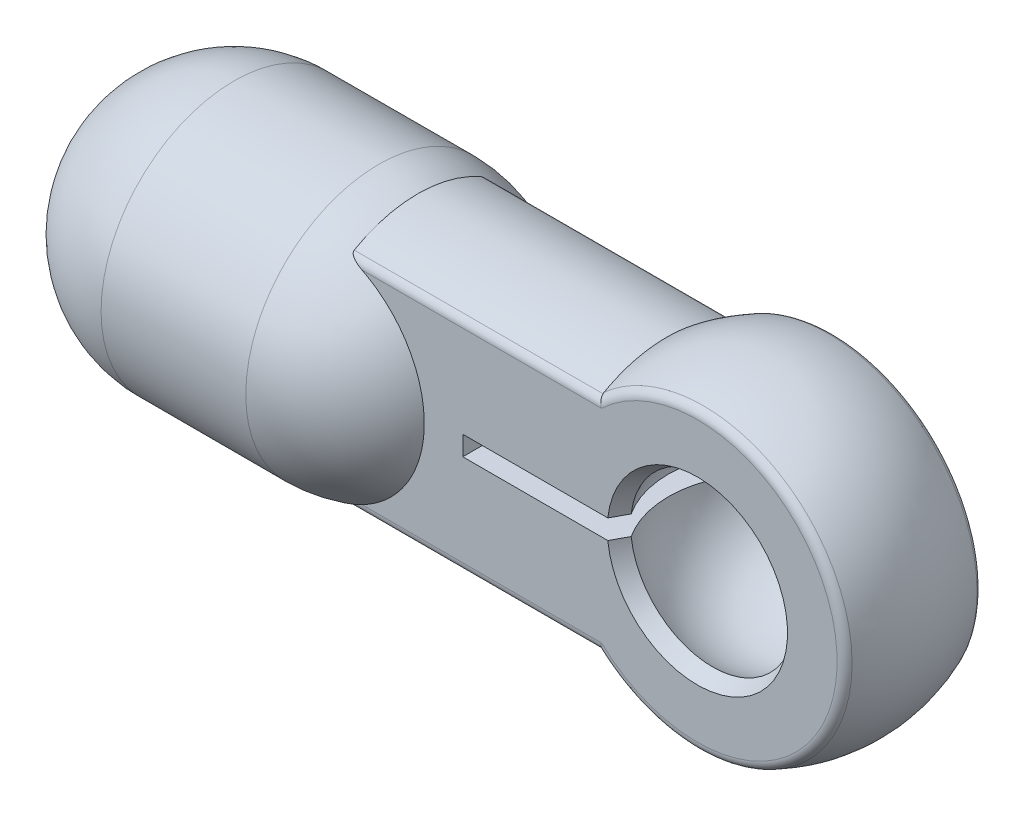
ISO-10303-21;
HEADER;
FILE_DESCRIPTION(('STEP AP214'),'2;1');
FILE_NAME('part.step','',(''),(''),'','','');
FILE_SCHEMA(('AUTOMOTIVE_DESIGN { 1 0 10303 214 1 1 1 1 }'));
ENDSEC;
DATA;
#1=APPLICATION_CONTEXT('core data for automotive mechanical design processes');
#2=APPLICATION_PROTOCOL_DEFINITION('international standard','automotive_design',2000,#1);
#3=PRODUCT_CONTEXT('',#1,'mechanical');
#4=PRODUCT('Part','Part','',(#3));
#5=PRODUCT_RELATED_PRODUCT_CATEGORY('part','',(#4));
#6=PRODUCT_DEFINITION_FORMATION('','',#4);
#7=PRODUCT_DEFINITION_CONTEXT('part definition',#1,'design');
#8=PRODUCT_DEFINITION('design','',#6,#7);
#9=PRODUCT_DEFINITION_SHAPE('','',#8);
#10=(LENGTH_UNIT() NAMED_UNIT(*) SI_UNIT(.MILLI.,.METRE.));
#11=(NAMED_UNIT(*) PLANE_ANGLE_UNIT() SI_UNIT($,.RADIAN.));
#12=(NAMED_UNIT(*) SI_UNIT($,.STERADIAN.) SOLID_ANGLE_UNIT());
#13=UNCERTAINTY_MEASURE_WITH_UNIT(LENGTH_MEASURE(1.E-05),#10,'distance_accuracy_value','');
#14=(GEOMETRIC_REPRESENTATION_CONTEXT(3) GLOBAL_UNCERTAINTY_ASSIGNED_CONTEXT((#13)) GLOBAL_UNIT_ASSIGNED_CONTEXT((#10,
#11,#12)) REPRESENTATION_CONTEXT('',''));
#15=CARTESIAN_POINT('',(0.,0.,0.));
#16=DIRECTION('',(0.,0.,1.));
#17=DIRECTION('',(1.,0.,0.));
#18=AXIS2_PLACEMENT_3D('',#15,#16,#17);
#19=CARTESIAN_POINT('',(-15.,0.,0.));
#20=DIRECTION('',(1.,0.,0.));
#21=DIRECTION('',(0.,0.,-1.));
#22=AXIS2_PLACEMENT_3D('',#19,#20,#21);
#23=PLANE('',#22);
#24=CARTESIAN_POINT('',(-15.,0.,0.));
#25=DIRECTION('',(1.,0.,0.));
#26=DIRECTION('',(0.,0.,-1.));
#27=AXIS2_PLACEMENT_3D('',#24,#25,#26);
#28=CIRCLE('',#27,2.1);
#29=CARTESIAN_POINT('',(-15.,0.,-2.1));
#30=VERTEX_POINT('',#29);
#31=EDGE_CURVE('E672',#30,#30,#28,.F.);
#32=ORIENTED_EDGE('',*,*,#31,.T.);
#33=EDGE_LOOP('',(#32));
#34=FACE_BOUND('',#33,.T.);
#35=ADVANCED_FACE('F16',(#34),#23,.F.);
#36=CARTESIAN_POINT('',(-15.,0.,0.));
#37=DIRECTION('',(1.,0.,0.));
#38=DIRECTION('',(0.,0.,-1.));
#39=AXIS2_PLACEMENT_3D('',#36,#37,#38);
#40=CYLINDRICAL_SURFACE('',#39,2.1);
#41=ORIENTED_EDGE('',*,*,#31,.F.);
#42=EDGE_LOOP('',(#41));
#43=FACE_BOUND('',#42,.T.);
#44=CARTESIAN_POINT('',(-33.66761161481,0.,0.));
#45=DIRECTION('',(1.,0.,0.));
#46=DIRECTION('',(0.,0.,-1.));
#47=AXIS2_PLACEMENT_3D('',#44,#45,#46);
#48=CIRCLE('',#47,2.1);
#49=CARTESIAN_POINT('',(-33.66761161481,0.,-2.1));
#50=VERTEX_POINT('',#49);
#51=EDGE_CURVE('E162',#50,#50,#48,.T.);
#52=ORIENTED_EDGE('',*,*,#51,.F.);
#53=EDGE_LOOP('',(#52));
#54=FACE_BOUND('',#53,.T.);
#55=ADVANCED_FACE('F779',(#43,#54),#40,.F.);
#56=CARTESIAN_POINT('',(-27.2,0.,0.));
#57=DIRECTION('',(0.,1.,0.));
#58=DIRECTION('',(0.,0.,-1.));
#59=AXIS2_PLACEMENT_3D('',#56,#57,#58);
#60=SPHERICAL_SURFACE('',#59,6.8);
#61=CARTESIAN_POINT('',(-27.2,0.,0.));
#62=DIRECTION('',(-1.,0.,0.));
#63=DIRECTION('',(0.,0.,1.));
#64=AXIS2_PLACEMENT_3D('',#61,#62,#63);
#65=CIRCLE('',#64,6.8);
#66=CARTESIAN_POINT('',(-27.2,6.8,0.));
#67=VERTEX_POINT('',#66);
#68=CARTESIAN_POINT('',(-27.2,-6.8,0.));
#69=VERTEX_POINT('',#68);
#70=EDGE_CURVE('E157',#67,#69,#65,.F.);
#71=ORIENTED_EDGE('',*,*,#70,.F.);
#72=CARTESIAN_POINT('',(-27.2,0.,0.));
#73=DIRECTION('',(-1.,0.,0.));
#74=DIRECTION('',(0.,0.,1.));
#75=AXIS2_PLACEMENT_3D('',#72,#73,#74);
#76=CIRCLE('',#75,6.8);
#77=EDGE_CURVE('E155',#69,#67,#76,.F.);
#78=ORIENTED_EDGE('',*,*,#77,.F.);
#79=EDGE_LOOP('',(#71,#78));
#80=FACE_BOUND('',#79,.T.);
#81=ORIENTED_EDGE('',*,*,#51,.T.);
#82=EDGE_LOOP('',(#81));
#83=FACE_BOUND('',#82,.T.);
#84=ADVANCED_FACE('F164',(#80,#83),#60,.T.);
#85=CARTESIAN_POINT('',(-68.3447,5.196152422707,3.));
#86=DIRECTION('',(1.,0.,0.));
#87=DIRECTION('',(0.,0.,-1.));
#88=AXIS2_PLACEMENT_3D('',#85,#86,#87);
#89=CYLINDRICAL_SURFACE('',#88,0.5);
#90=DIRECTION('',(-1.,0.,0.));
#91=VECTOR('',#90,1.);
#92=CARTESIAN_POINT('',(9.9125,5.62916512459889,3.24999999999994));
#93=LINE('',#92,#91);
#94=CARTESIAN_POINT('',(-17.8025015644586,5.62916512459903,3.25000000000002));
#95=VERTEX_POINT('',#94);
#96=CARTESIAN_POINT('',(-5.07453908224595,5.62916512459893,3.24999999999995));
#97=VERTEX_POINT('',#96);
#98=EDGE_CURVE('E508',#95,#97,#93,.F.);
#99=ORIENTED_EDGE('',*,*,#98,.F.);
#100=CARTESIAN_POINT('',(-17.1561391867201,5.19615242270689,3.5));
#101=CARTESIAN_POINT('',(-17.1809328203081,5.20877080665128,3.4999955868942));
#102=CARTESIAN_POINT('',(-17.2056916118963,5.22146374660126,3.49952206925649));
#103=CARTESIAN_POINT('',(-17.2552107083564,5.24708021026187,3.49756750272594));
#104=CARTESIAN_POINT('',(-17.2799703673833,5.260004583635,3.49608128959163));
#105=CARTESIAN_POINT('',(-17.3293577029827,5.28606308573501,3.4920264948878));
#106=CARTESIAN_POINT('',(-17.3539849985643,5.29919759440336,3.48945567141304));
#107=CARTESIAN_POINT('',(-17.403207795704,5.32581042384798,3.48309214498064));
#108=CARTESIAN_POINT('',(-17.4278007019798,5.33929083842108,3.47928790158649));
#109=CARTESIAN_POINT('',(-17.4765456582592,5.36650231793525,3.47030415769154));
#110=CARTESIAN_POINT('',(-17.5006983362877,5.38023295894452,3.46512681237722));
#111=CARTESIAN_POINT('',(-17.548366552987,5.40802563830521,3.45314364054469));
#112=CARTESIAN_POINT('',(-17.5718829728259,5.42208716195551,3.44634020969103));
#113=CARTESIAN_POINT('',(-17.6114926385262,5.44667329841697,3.43287029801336));
#114=CARTESIAN_POINT('',(-17.6278215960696,5.45708651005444,3.42669827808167));
#115=CARTESIAN_POINT('',(-17.6597580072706,5.4782332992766,3.41302474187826));
#116=CARTESIAN_POINT('',(-17.6753642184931,5.48896737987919,3.40552103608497));
#117=CARTESIAN_POINT('',(-17.7055509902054,5.51090956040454,3.38874352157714));
#118=CARTESIAN_POINT('',(-17.7201193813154,5.52212139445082,3.37945233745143));
#119=CARTESIAN_POINT('',(-17.7472020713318,5.5449330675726,3.35859438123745));
#120=CARTESIAN_POINT('',(-17.7597241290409,5.5565312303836,3.34703658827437));
#121=CARTESIAN_POINT('',(-17.7759586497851,5.57430475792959,3.32723573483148));
#122=CARTESIAN_POINT('',(-17.7810184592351,5.58041766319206,3.32005522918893));
#123=CARTESIAN_POINT('',(-17.7897549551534,5.59257273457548,3.30486882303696));
#124=CARTESIAN_POINT('',(-17.7934369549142,5.59861508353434,3.29686624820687));
#125=CARTESIAN_POINT('',(-17.7982658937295,5.60881255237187,3.28242918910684));
#126=CARTESIAN_POINT('',(-17.7998329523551,5.61302554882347,3.27617684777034));
#127=CARTESIAN_POINT('',(-17.8019607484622,5.62126689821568,3.26332004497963));
#128=CARTESIAN_POINT('',(-17.8025138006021,5.62529361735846,3.25671328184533));
#129=CARTESIAN_POINT('',(-17.8025015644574,5.62916512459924,3.25000000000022));
#130=B_SPLINE_CURVE_WITH_KNOTS('',3,(#100,#101,#102,#103,#104,#105,#106,#107,#108,#109,#110,
#111,#112,#113,#114,#115,#116,#117,#118,#119,#120,#121,#122,#123,#124,#125,#126,#127,#128,#129),
.UNSPECIFIED.,.F.,.F.,(4,2,2,2,2,2,2,2,2,2,2,2,2,2,4),(0.,0.0834598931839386,0.167348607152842,
0.251411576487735,0.336284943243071,0.421025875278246,0.505642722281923,0.566580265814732,
0.62761894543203,0.689284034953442,0.750709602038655,0.782724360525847,0.814614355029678,
0.837643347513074,0.860846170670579),.UNSPECIFIED.);
#131=CARTESIAN_POINT('',(-17.15613918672,5.19615242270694,3.5));
#132=VERTEX_POINT('',#131);
#133=EDGE_CURVE('E169',#132,#95,#130,.T.);
#134=ORIENTED_EDGE('',*,*,#133,.F.);
#135=DIRECTION('',(-1.,0.,0.));
#136=VECTOR('',#135,1.);
#137=CARTESIAN_POINT('',(8.25,5.196152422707,3.5));
#138=LINE('',#137,#136);
#139=CARTESIAN_POINT('',(-4.905354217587,5.196152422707,3.5));
#140=VERTEX_POINT('',#139);
#141=EDGE_CURVE('E631',#132,#140,#138,.F.);
#142=ORIENTED_EDGE('',*,*,#141,.T.);
#143=CARTESIAN_POINT('',(-5.07453908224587,5.62916512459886,3.24999999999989));
#144=CARTESIAN_POINT('',(-5.07356515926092,5.62662992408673,3.25439102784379));
#145=CARTESIAN_POINT('',(-5.07256691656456,5.62402978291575,3.25873912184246));
#146=CARTESIAN_POINT('',(-5.07051209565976,5.61867611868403,3.26738989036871));
#147=CARTESIAN_POINT('',(-5.06945502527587,5.61592129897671,3.27169164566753));
#148=CARTESIAN_POINT('',(-5.06728175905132,5.61025800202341,3.28024366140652));
#149=CARTESIAN_POINT('',(-5.0661650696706,5.60734824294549,3.28449294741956));
#150=CARTESIAN_POINT('',(-5.06387193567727,5.60137497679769,3.29293386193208));
#151=CARTESIAN_POINT('',(-5.06269499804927,5.5983102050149,3.29712446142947));
#152=CARTESIAN_POINT('',(-5.0602808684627,5.59202700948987,3.30544170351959));
#153=CARTESIAN_POINT('',(-5.05904318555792,5.58880734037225,3.30956726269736));
#154=CARTESIAN_POINT('',(-5.05650721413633,5.58221464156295,3.31774801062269));
#155=CARTESIAN_POINT('',(-5.05520843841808,5.57884038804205,3.32180206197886));
#156=CARTESIAN_POINT('',(-5.05255008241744,5.57193901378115,3.32983327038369));
#157=CARTESIAN_POINT('',(-5.05119002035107,5.56841069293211,3.33380923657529));
#158=CARTESIAN_POINT('',(-5.04840905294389,5.56120188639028,3.34167765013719));
#159=CARTESIAN_POINT('',(-5.04698767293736,5.55752022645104,3.34556885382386));
#160=CARTESIAN_POINT('',(-5.04408419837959,5.55000565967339,3.35326102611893));
#161=CARTESIAN_POINT('',(-5.0426016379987,5.5461716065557,3.35706069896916));
#162=CARTESIAN_POINT('',(-5.03957610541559,5.53835339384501,3.36456301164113));
#163=CARTESIAN_POINT('',(-5.03803267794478,5.53436811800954,3.36826430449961));
#164=CARTESIAN_POINT('',(-5.03488589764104,5.52624882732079,3.37556298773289));
#165=CARTESIAN_POINT('',(-5.03328210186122,5.52211372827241,3.37915898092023));
#166=CARTESIAN_POINT('',(-5.03001525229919,5.51369639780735,3.3862401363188));
#167=CARTESIAN_POINT('',(-5.02835176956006,5.50941311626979,3.38972385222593));
#168=CARTESIAN_POINT('',(-5.02496643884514,5.50070124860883,3.39657347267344));
#169=CARTESIAN_POINT('',(-5.02324417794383,5.49627164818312,3.39993788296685));
#170=CARTESIAN_POINT('',(-5.01974227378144,5.48726928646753,3.40654189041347));
#171=CARTESIAN_POINT('',(-5.01796223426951,5.48269554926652,3.409779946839));
#172=CARTESIAN_POINT('',(-5.01434639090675,5.47340703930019,3.41612416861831));
#173=CARTESIAN_POINT('',(-5.01251021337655,5.46869132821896,3.41922874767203));
#174=CARTESIAN_POINT('',(-5.00878231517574,5.45912226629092,3.42529913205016));
#175=CARTESIAN_POINT('',(-5.00689022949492,5.45426802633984,3.42826330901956));
#176=CARTESIAN_POINT('',(-5.00196051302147,5.44160498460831,3.43569927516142));
#177=CARTESIAN_POINT('',(-4.99889969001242,5.43372755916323,3.44003964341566));
#178=CARTESIAN_POINT('',(-4.99248718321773,5.41721527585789,3.44856494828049));
#179=CARTESIAN_POINT('',(-4.98913012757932,5.40856597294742,3.45271779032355));
#180=CARTESIAN_POINT('',(-4.98210656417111,5.39050047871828,3.46076542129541));
#181=CARTESIAN_POINT('',(-4.97843416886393,5.3810711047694,3.46462562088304));
#182=CARTESIAN_POINT('',(-4.9727723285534,5.36657060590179,3.47005544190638));
#183=CARTESIAN_POINT('',(-4.9708156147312,5.3615658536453,3.47183942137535));
#184=CARTESIAN_POINT('',(-4.9668210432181,5.35136322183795,3.47529520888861));
#185=CARTESIAN_POINT('',(-4.96478248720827,5.34616397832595,3.47696220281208));
#186=CARTESIAN_POINT('',(-4.96062417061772,5.33557383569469,3.48016841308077));
#187=CARTESIAN_POINT('',(-4.95850374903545,5.33018169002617,3.48170264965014));
#188=CARTESIAN_POINT('',(-4.95418209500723,5.31920759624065,3.48462738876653));
#189=CARTESIAN_POINT('',(-4.95198024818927,5.31362451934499,3.48601275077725));
#190=CARTESIAN_POINT('',(-4.94749678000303,5.30227120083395,3.48862331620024));
#191=CARTESIAN_POINT('',(-4.94521460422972,5.2964999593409,3.4898432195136));
#192=CARTESIAN_POINT('',(-4.9405721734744,5.28477368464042,3.49210606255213));
#193=CARTESIAN_POINT('',(-4.93821143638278,5.27881778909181,3.49314354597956));
#194=CARTESIAN_POINT('',(-4.93341430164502,5.26672639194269,3.49502440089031));
#195=CARTESIAN_POINT('',(-4.93097750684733,5.26059017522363,3.49586216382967));
#196=CARTESIAN_POINT('',(-4.9260314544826,5.24814317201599,3.49732615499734));
#197=CARTESIAN_POINT('',(-4.92352189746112,5.24183182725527,3.49794662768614));
#198=CARTESIAN_POINT('',(-4.91843433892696,5.22904051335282,3.49895837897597));
#199=CARTESIAN_POINT('',(-4.91585614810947,5.22256015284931,3.49934376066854));
#200=CARTESIAN_POINT('',(-4.9106362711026,5.20943766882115,3.49986761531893));
#201=CARTESIAN_POINT('',(-4.9079945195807,5.20279533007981,3.50000005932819));
#202=CARTESIAN_POINT('',(-4.905354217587,5.196152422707,3.5));
#203=B_SPLINE_CURVE_WITH_KNOTS('',3,(#143,#144,#145,#146,#147,#148,#149,#150,#151,#152,#153,
#154,#155,#156,#157,#158,#159,#160,#161,#162,#163,#164,#165,#166,#167,#168,#169,#170,#171,#172,
#173,#174,#175,#176,#177,#178,#179,#180,#181,#182,#183,#184,#185,#186,#187,#188,#189,#190,#191,
#192,#193,#194,#195,#196,#197,#198,#199,#200,#201,#202),.UNSPECIFIED.,.F.,.F.,(4,2,2,2,2,2,2,2,
2,2,2,2,2,2,2,2,2,2,2,2,2,2,2,2,2,2,2,2,2,4),(0.,0.0154883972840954,0.0311351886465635,
0.046941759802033,0.0629094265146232,0.0790394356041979,0.0953329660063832,0.111791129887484,
0.128414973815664,0.14520547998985,0.162163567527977,0.179290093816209,0.196585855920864,
0.214051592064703,0.231687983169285,0.249495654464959,0.267475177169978,0.295963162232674,
0.326443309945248,0.358914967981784,0.375899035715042,0.393380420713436,0.411358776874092,
0.429833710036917,0.448804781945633,0.468271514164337,0.488233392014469,0.508689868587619,
0.529640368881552,0.551084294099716),.UNSPECIFIED.);
#204=EDGE_CURVE('E161',#97,#140,#203,.T.);
#205=ORIENTED_EDGE('',*,*,#204,.F.);
#206=EDGE_LOOP('',(#99,#134,#142,#205));
#207=FACE_BOUND('',#206,.T.);
#208=ADVANCED_FACE('F409',(#207),#89,.T.);
#209=CARTESIAN_POINT('',(0.,0.,3.));
#210=DIRECTION('',(0.,0.,-1.));
#211=DIRECTION('',(0.998982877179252,-0.0450911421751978,0.));
#212=AXIS2_PLACEMENT_3D('',#209,#210,#211);
#213=TOROIDAL_SURFACE('',#212,7.145802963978,0.5);
#214=CARTESIAN_POINT('',(-5.080600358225,-5.66138222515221,3.19354838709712));
#215=CARTESIAN_POINT('',(-5.0806003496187,-5.66001765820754,3.19596743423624));
#216=CARTESIAN_POINT('',(-5.08056895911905,-5.6586515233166,3.1983856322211));
#217=CARTESIAN_POINT('',(-5.08044262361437,-5.65592585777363,3.20320313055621));
#218=CARTESIAN_POINT('',(-5.0803480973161,-5.65456634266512,3.20560245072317));
#219=CARTESIAN_POINT('',(-5.08009549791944,-5.65185398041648,3.21038223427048));
#220=CARTESIAN_POINT('',(-5.07993781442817,-5.65050114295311,3.21276272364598));
#221=CARTESIAN_POINT('',(-5.07955893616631,-5.64780221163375,3.21750486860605));
#222=CARTESIAN_POINT('',(-5.0793380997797,-5.64645612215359,3.21986655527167));
#223=CARTESIAN_POINT('',(-5.07883294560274,-5.64377075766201,3.22457112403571));
#224=CARTESIAN_POINT('',(-5.07854895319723,-5.64243148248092,3.22691404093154));
#225=CARTESIAN_POINT('',(-5.07791752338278,-5.6397598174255,3.23158109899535));
#226=CARTESIAN_POINT('',(-5.07757037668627,-5.63842742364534,3.23390527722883));
#227=CARTESIAN_POINT('',(-5.07681266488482,-5.63576958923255,3.23853488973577));
#228=CARTESIAN_POINT('',(-5.07640235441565,-5.63444414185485,3.24084036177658));
#229=CARTESIAN_POINT('',(-5.07551838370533,-5.63180027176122,3.2454325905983));
#230=CARTESIAN_POINT('',(-5.07504494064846,-5.63048184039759,3.2477193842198));
#231=CARTESIAN_POINT('',(-5.074539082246,-5.62916512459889,3.24999999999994));
#232=B_SPLINE_CURVE_WITH_KNOTS('',3,(#214,#215,#216,#217,#218,#219,#220,#221,#222,#223,#224,
#225,#226,#227,#228,#229,#230,#231),.UNSPECIFIED.,.F.,.F.,(4,2,2,2,2,2,2,2,4),(0.,
0.0083320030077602,0.0166092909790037,0.0248362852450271,0.0330174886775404,0.0411574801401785,
0.0492609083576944,0.0573324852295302,0.0653769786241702),.UNSPECIFIED.);
#233=CARTESIAN_POINT('',(-5.08060035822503,-5.66138222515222,3.1935483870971));
#234=VERTEX_POINT('',#233);
#235=CARTESIAN_POINT('',(-5.07453908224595,-5.62916512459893,3.24999999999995));
#236=VERTEX_POINT('',#235);
#237=EDGE_CURVE('E516',#234,#236,#232,.T.);
#238=ORIENTED_EDGE('',*,*,#237,.F.);
#239=CARTESIAN_POINT('',(0.,0.,3.19354838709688));
#240=DIRECTION('',(0.,0.,-1.));
#241=DIRECTION('',(0.998982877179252,-0.0450911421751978,0.));
#242=AXIS2_PLACEMENT_3D('',#239,#240,#241);
#243=CIRCLE('',#242,7.60682251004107);
#244=CARTESIAN_POINT('',(-5.080600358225,5.66138222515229,3.193548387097));
#245=VERTEX_POINT('',#244);
#246=EDGE_CURVE('E667',#234,#245,#243,.F.);
#247=ORIENTED_EDGE('',*,*,#246,.T.);
#248=CARTESIAN_POINT('',(-5.074539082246,5.62916512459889,3.24999999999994));
#249=CARTESIAN_POINT('',(-5.0750449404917,5.63048183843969,3.24771938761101));
#250=CARTESIAN_POINT('',(-5.0755183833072,5.63180026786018,3.24543259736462));
#251=CARTESIAN_POINT('',(-5.0764023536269,5.63444413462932,3.24084037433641));
#252=CARTESIAN_POINT('',(-5.07681266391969,5.6357695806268,3.23853490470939));
#253=CARTESIAN_POINT('',(-5.07757037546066,5.63842741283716,3.23390529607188));
#254=CARTESIAN_POINT('',(-5.07791752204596,5.63975980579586,3.23158111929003));
#255=CARTESIAN_POINT('',(-5.07854895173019,5.6424314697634,3.22691406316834));
#256=CARTESIAN_POINT('',(-5.07883294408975,5.64377074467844,3.2245711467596));
#257=CARTESIAN_POINT('',(-5.07933809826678,5.64645610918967,3.21986657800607));
#258=CARTESIAN_POINT('',(-5.07955893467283,5.64780219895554,3.21750489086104));
#259=CARTESIAN_POINT('',(-5.07993781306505,5.65050113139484,3.21276274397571));
#260=CARTESIAN_POINT('',(-5.08009549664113,5.65185396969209,3.2103822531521));
#261=CARTESIAN_POINT('',(-5.0803480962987,5.65456633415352,3.20560246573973));
#262=CARTESIAN_POINT('',(-5.08044262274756,5.65592585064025,3.2032031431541));
#263=CARTESIAN_POINT('',(-5.0805689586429,5.65865151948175,3.19838563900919));
#264=CARTESIAN_POINT('',(-5.08060034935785,5.66001765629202,3.195967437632));
#265=CARTESIAN_POINT('',(-5.080600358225,5.66138222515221,3.19354838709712));
#266=B_SPLINE_CURVE_WITH_KNOTS('',3,(#248,#249,#250,#251,#252,#253,#254,#255,#256,#257,#258,
#259,#260,#261,#262,#263,#264,#265),.UNSPECIFIED.,.F.,.F.,(4,2,2,2,2,2,2,2,4),(0.,
0.00804448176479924,0.0161160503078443,0.0242194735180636,0.0323594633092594,0.0405406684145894,
0.0487676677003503,0.0570449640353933,0.0653769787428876),.UNSPECIFIED.);
#267=EDGE_CURVE('E503',#97,#245,#266,.T.);
#268=ORIENTED_EDGE('',*,*,#267,.F.);
#269=ORIENTED_EDGE('',*,*,#204,.T.);
#270=CARTESIAN_POINT('',(0.,0.,3.5));
#271=DIRECTION('',(0.,0.,-1.));
#272=DIRECTION('',(-0.686466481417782,0.727161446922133,0.));
#273=AXIS2_PLACEMENT_3D('',#270,#271,#272);
#274=CIRCLE('',#273,7.14580296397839);
#275=CARTESIAN_POINT('',(7.13853480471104,-0.322212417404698,3.5));
#276=VERTEX_POINT('',#275);
#277=EDGE_CURVE('E607',#140,#276,#274,.T.);
#278=ORIENTED_EDGE('',*,*,#277,.T.);
#279=CARTESIAN_POINT('',(0.,0.,3.5));
#280=DIRECTION('',(0.,0.,-1.));
#281=DIRECTION('',(0.998982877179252,-0.0450911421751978,0.));
#282=AXIS2_PLACEMENT_3D('',#279,#280,#281);
#283=CIRCLE('',#282,7.14580296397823);
#284=CARTESIAN_POINT('',(-4.90535421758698,-5.19615242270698,3.5));
#285=VERTEX_POINT('',#284);
#286=EDGE_CURVE('E391',#276,#285,#283,.T.);
#287=ORIENTED_EDGE('',*,*,#286,.T.);
#288=CARTESIAN_POINT('',(-4.905354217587,-5.196152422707,3.5));
#289=CARTESIAN_POINT('',(-4.90799419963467,-5.20279452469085,3.50000005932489));
#290=CARTESIAN_POINT('',(-4.91063564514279,-5.20943605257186,3.49986764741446));
#291=CARTESIAN_POINT('',(-4.91585511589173,-5.22255735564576,3.49934390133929));
#292=CARTESIAN_POINT('',(-4.9184332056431,-5.22903734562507,3.498958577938));
#293=CARTESIAN_POINT('',(-4.92352076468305,-5.24182836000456,3.49794693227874));
#294=CARTESIAN_POINT('',(-4.92603042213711,-5.24813977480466,3.49732648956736));
#295=CARTESIAN_POINT('',(-4.93097687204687,-5.26058735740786,3.49586249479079));
#296=CARTESIAN_POINT('',(-4.93341396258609,-5.26672408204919,3.49502468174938));
#297=CARTESIAN_POINT('',(-4.93821187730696,-5.27881692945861,3.49314361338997));
#298=CARTESIAN_POINT('',(-4.94057309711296,-5.28477376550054,3.49210595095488));
#299=CARTESIAN_POINT('',(-4.94521667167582,-5.29650234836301,3.48984259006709));
#300=CARTESIAN_POINT('',(-4.94749950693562,-5.30227495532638,3.48862233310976));
#301=CARTESIAN_POINT('',(-4.95198446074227,-5.31363142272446,3.48601085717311));
#302=CARTESIAN_POINT('',(-4.95418713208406,-5.31921628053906,3.48462492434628));
#303=CARTESIAN_POINT('',(-4.95851058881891,-5.33019434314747,3.48169880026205));
#304=CARTESIAN_POINT('',(-4.96063198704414,-5.33558867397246,3.48016373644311));
#305=CARTESIAN_POINT('',(-4.96479239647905,-5.34618358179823,3.47695559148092));
#306=CARTESIAN_POINT('',(-4.96683206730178,-5.35138540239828,3.47528747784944));
#307=CARTESIAN_POINT('',(-4.97082899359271,-5.36159356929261,3.47182913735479));
#308=CARTESIAN_POINT('',(-4.97278694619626,-5.36660127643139,3.47004371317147));
#309=CARTESIAN_POINT('',(-4.97845291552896,-5.38111184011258,3.46460881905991));
#310=CARTESIAN_POINT('',(-4.98212810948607,-5.3905482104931,3.46074463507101));
#311=CARTESIAN_POINT('',(-4.98915760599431,-5.40862905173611,3.45268749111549));
#312=CARTESIAN_POINT('',(-4.99251779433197,-5.41728667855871,3.4485290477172));
#313=CARTESIAN_POINT('',(-4.99893670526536,-5.43381688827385,3.43999084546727));
#314=CARTESIAN_POINT('',(-5.0020008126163,-5.44170388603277,3.43564311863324));
#315=CARTESIAN_POINT('',(-5.00693140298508,-5.45437138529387,3.42820055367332));
#316=CARTESIAN_POINT('',(-5.00882126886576,-5.45922089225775,3.42523783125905));
#317=CARTESIAN_POINT('',(-5.01254497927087,-5.46878084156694,3.4191705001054));
#318=CARTESIAN_POINT('',(-5.01437918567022,-5.47349216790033,3.41606750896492));
#319=CARTESIAN_POINT('',(-5.01799128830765,-5.48277228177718,3.4097265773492));
#320=CARTESIAN_POINT('',(-5.0197695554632,-5.48734200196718,3.40649021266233));
#321=CARTESIAN_POINT('',(-5.02326812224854,-5.49633669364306,3.39988966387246));
#322=CARTESIAN_POINT('',(-5.02498881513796,-5.50076263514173,3.39652701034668));
#323=CARTESIAN_POINT('',(-5.02837120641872,-5.50946754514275,3.38968094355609));
#324=CARTESIAN_POINT('',(-5.03003331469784,-5.51374752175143,3.38619901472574));
#325=CARTESIAN_POINT('',(-5.03329760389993,-5.52215859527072,3.3791214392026));
#326=CARTESIAN_POINT('',(-5.03490021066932,-5.52629073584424,3.37552722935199));
#327=CARTESIAN_POINT('',(-5.03804479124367,-5.5344044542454,3.36823208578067));
#328=CARTESIAN_POINT('',(-5.03958720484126,-5.53838710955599,3.36453254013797));
#329=CARTESIAN_POINT('',(-5.04261087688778,-5.54620041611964,3.35703366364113));
#330=CARTESIAN_POINT('',(-5.04409258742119,-5.55003217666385,3.35323567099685));
#331=CARTESIAN_POINT('',(-5.04699451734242,-5.55754248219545,3.34554677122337));
#332=CARTESIAN_POINT('',(-5.04841519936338,-5.56122216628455,3.34165715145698));
#333=CARTESIAN_POINT('',(-5.05119491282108,-5.56842733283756,3.33379178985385));
#334=CARTESIAN_POINT('',(-5.05255441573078,-5.57195398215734,3.32981728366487));
#335=CARTESIAN_POINT('',(-5.05521178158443,-5.57885231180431,3.32178885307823));
#336=CARTESIAN_POINT('',(-5.05651012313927,-5.58222518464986,3.31773611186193));
#337=CARTESIAN_POINT('',(-5.05904533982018,-5.58881540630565,3.30955781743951));
#338=CARTESIAN_POINT('',(-5.06028269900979,-5.59203397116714,3.30543339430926));
#339=CARTESIAN_POINT('',(-5.06269627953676,-5.59831522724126,3.2971182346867));
#340=CARTESIAN_POINT('',(-5.0638729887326,-5.60137915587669,3.29292857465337));
#341=CARTESIAN_POINT('',(-5.06616574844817,-5.60735098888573,3.28448932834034));
#342=CARTESIAN_POINT('',(-5.06728228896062,-5.61026014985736,3.28024076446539));
#343=CARTESIAN_POINT('',(-5.06945532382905,-5.61592248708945,3.27168996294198));
#344=CARTESIAN_POINT('',(-5.07051230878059,-5.61867693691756,3.26738869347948));
#345=CARTESIAN_POINT('',(-5.07256700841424,-5.62403008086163,3.25873864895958));
#346=CARTESIAN_POINT('',(-5.07356521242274,-5.62663006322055,3.25439078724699));
#347=CARTESIAN_POINT('',(-5.07453908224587,-5.62916512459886,3.24999999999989));
#348=B_SPLINE_CURVE_WITH_KNOTS('',3,(#288,#289,#290,#291,#292,#293,#294,#295,#296,#297,#298,
#299,#300,#301,#302,#303,#304,#305,#306,#307,#308,#309,#310,#311,#312,#313,#314,#315,#316,#317,
#318,#319,#320,#321,#322,#323,#324,#325,#326,#327,#328,#329,#330,#331,#332,#333,#334,#335,#336,
#337,#338,#339,#340,#341,#342,#343,#344,#345,#346,#347),.UNSPECIFIED.,.F.,.F.,(4,2,2,2,2,2,2,2,
2,2,2,2,2,2,2,2,2,2,2,2,2,2,2,2,2,2,2,2,2,4),(0.,0.0214413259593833,0.0423906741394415,
0.0628474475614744,0.0828110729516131,0.102281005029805,0.12125673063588,0.139737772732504,
0.157723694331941,0.175214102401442,0.192208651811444,0.224705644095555,0.25521696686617,
0.283741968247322,0.301705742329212,0.319498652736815,0.33712127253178,0.354574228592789,
0.371858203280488,0.388973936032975,0.405922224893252,0.422703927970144,0.439319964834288,
0.455771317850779,0.472059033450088,0.48818422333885,0.504148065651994,0.519951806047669,
0.535596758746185,0.551084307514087),.UNSPECIFIED.);
#349=EDGE_CURVE('E436',#236,#285,#348,.F.);
#350=ORIENTED_EDGE('',*,*,#349,.F.);
#351=EDGE_LOOP('',(#238,#247,#268,#269,#278,#287,#350));
#352=FACE_BOUND('',#351,.T.);
#353=ADVANCED_FACE('F397',(#352),#213,.T.);
#354=CARTESIAN_POINT('',(51.5947,-5.196152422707,3.));
#355=DIRECTION('',(-1.,0.,0.));
#356=DIRECTION('',(0.,0.,1.));
#357=AXIS2_PLACEMENT_3D('',#354,#355,#356);
#358=CYLINDRICAL_SURFACE('',#357,0.5);
#359=DIRECTION('',(-1.,0.,0.));
#360=VECTOR('',#359,1.);
#361=CARTESIAN_POINT('',(8.25,-5.196152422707,3.5));
#362=LINE('',#361,#360);
#363=CARTESIAN_POINT('',(-17.1561391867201,-5.19615242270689,3.5));
#364=VERTEX_POINT('',#363);
#365=EDGE_CURVE('E373',#285,#364,#362,.T.);
#366=ORIENTED_EDGE('',*,*,#365,.T.);
#367=CARTESIAN_POINT('',(-17.8025015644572,-5.62916512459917,3.2500000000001));
#368=CARTESIAN_POINT('',(-17.8025362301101,-5.62391671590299,3.25911214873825));
#369=CARTESIAN_POINT('',(-17.8015066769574,-5.61838991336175,3.26800088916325));
#370=CARTESIAN_POINT('',(-17.7976575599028,-5.60708314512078,3.28501886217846));
#371=CARTESIAN_POINT('',(-17.7948656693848,-5.60130835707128,3.29315764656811));
#372=CARTESIAN_POINT('',(-17.7868534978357,-5.58804852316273,3.31075935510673));
#373=CARTESIAN_POINT('',(-17.7811793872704,-5.58052531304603,3.31998077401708));
#374=CARTESIAN_POINT('',(-17.7681448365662,-5.56548551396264,3.33723098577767));
#375=CARTESIAN_POINT('',(-17.7607734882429,-5.55796929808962,3.3452514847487));
#376=CARTESIAN_POINT('',(-17.7384809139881,-5.53704762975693,3.36627578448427));
#377=CARTESIAN_POINT('',(-17.7222792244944,-5.52380127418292,3.37805637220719));
#378=CARTESIAN_POINT('',(-17.6879770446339,-5.49783456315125,3.39908099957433));
#379=CARTESIAN_POINT('',(-17.669872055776,-5.4851155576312,3.40831883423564));
#380=CARTESIAN_POINT('',(-17.6234547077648,-5.45399449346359,3.42897390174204));
#381=CARTESIAN_POINT('',(-17.5944728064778,-5.43584811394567,3.43925469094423));
#382=CARTESIAN_POINT('',(-17.5352427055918,-5.4001783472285,3.45690997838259));
#383=CARTESIAN_POINT('',(-17.5049919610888,-5.38265635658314,3.46427829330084));
#384=CARTESIAN_POINT('',(-17.44369672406,-5.34803408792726,3.47672924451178));
#385=CARTESIAN_POINT('',(-17.4126505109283,-5.33093491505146,3.48180638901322));
#386=CARTESIAN_POINT('',(-17.3501125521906,-5.29708648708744,3.49001546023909));
#387=CARTESIAN_POINT('',(-17.3186207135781,-5.28033730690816,3.49314697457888));
#388=CARTESIAN_POINT('',(-17.2652208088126,-5.25230399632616,3.4969707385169));
#389=CARTESIAN_POINT('',(-17.2433839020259,-5.24094310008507,3.49811899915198));
#390=CARTESIAN_POINT('',(-17.1997536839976,-5.21842007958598,3.49963006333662));
#391=CARTESIAN_POINT('',(-17.1779609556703,-5.20725715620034,3.49999773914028));
#392=CARTESIAN_POINT('',(-17.1561391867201,-5.19615242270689,3.5));
#393=B_SPLINE_CURVE_WITH_KNOTS('',3,(#367,#368,#369,#370,#371,#372,#373,#374,#375,#376,#377,
#378,#379,#380,#381,#382,#383,#384,#385,#386,#387,#388,#389,#390,#391,#392),.UNSPECIFIED.,.F.,
.F.,(4,2,2,2,2,2,2,2,2,2,2,2,4),(0.,0.0314039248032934,0.0623265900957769,0.101655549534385,
0.141244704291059,0.212888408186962,0.284705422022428,0.391569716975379,0.498659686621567,
0.606004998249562,0.713373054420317,0.7872876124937,0.860739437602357),.UNSPECIFIED.);
#394=CARTESIAN_POINT('',(-17.8025015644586,-5.62916512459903,3.25000000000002));
#395=VERTEX_POINT('',#394);
#396=EDGE_CURVE('E166',#395,#364,#393,.T.);
#397=ORIENTED_EDGE('',*,*,#396,.F.);
#398=DIRECTION('',(-1.,0.,0.));
#399=VECTOR('',#398,1.);
#400=CARTESIAN_POINT('',(9.9125,-5.62916512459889,3.24999999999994));
#401=LINE('',#400,#399);
#402=EDGE_CURVE('E518',#236,#395,#401,.T.);
#403=ORIENTED_EDGE('',*,*,#402,.F.);
#404=ORIENTED_EDGE('',*,*,#349,.T.);
#405=EDGE_LOOP('',(#366,#397,#403,#404));
#406=FACE_BOUND('',#405,.T.);
#407=ADVANCED_FACE('F408',(#406),#358,.T.);
#408=CARTESIAN_POINT('',(0.,0.,3.50000551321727));
#409=DIRECTION('',(0.,0.,1.));
#410=DIRECTION('',(1.,0.,0.));
#411=AXIS2_PLACEMENT_3D('',#408,#409,#410);
#412=CONICAL_SURFACE('',#411,4.60971010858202,0.496926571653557);
#413=CARTESIAN_POINT('',(-4.16073290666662,0.5,2.72731913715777));
#414=CARTESIAN_POINT('',(-4.23106344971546,0.5,2.85608176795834));
#415=CARTESIAN_POINT('',(-4.30137708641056,0.5,2.98485362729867));
#416=CARTESIAN_POINT('',(-4.44197054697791,0.5,3.24241580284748));
#417=CARTESIAN_POINT('',(-4.5122503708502,0.5,3.37120611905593));
#418=CARTESIAN_POINT('',(-4.58251328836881,0.5,3.50000566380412));
#419=B_SPLINE_CURVE_WITH_KNOTS('',3,(#413,#414,#415,#416,#417,#418),.UNSPECIFIED.,.F.,.F.,(4,2,
4),(0.,0.440154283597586,0.880308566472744),.UNSPECIFIED.);
#420=CARTESIAN_POINT('',(-4.1607337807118,0.49999999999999,2.7273207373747));
#421=VERTEX_POINT('',#420);
#422=CARTESIAN_POINT('',(-4.58251174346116,0.5,3.50000283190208));
#423=VERTEX_POINT('',#422);
#424=EDGE_CURVE('E167',#421,#423,#419,.T.);
#425=ORIENTED_EDGE('',*,*,#424,.F.);
#426=CARTESIAN_POINT('',(0.,0.,2.72732233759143));
#427=DIRECTION('',(0.,0.,1.));
#428=DIRECTION('',(1.,0.,0.));
#429=AXIS2_PLACEMENT_3D('',#426,#427,#428);
#430=CIRCLE('',#429,4.19066973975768);
#431=CARTESIAN_POINT('',(-4.16073472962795,-0.499999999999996,2.72732247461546));
#432=VERTEX_POINT('',#431);
#433=EDGE_CURVE('E634',#421,#432,#430,.F.);
#434=ORIENTED_EDGE('',*,*,#433,.T.);
#435=CARTESIAN_POINT('',(-4.58251221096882,-0.5,3.5000036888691));
#436=CARTESIAN_POINT('',(-4.51224978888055,-0.5,3.37120505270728));
#437=CARTESIAN_POINT('',(-4.44197046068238,-0.5,3.2424156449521));
#438=CARTESIAN_POINT('',(-4.30137799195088,-0.5,2.98485528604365));
#439=CARTESIAN_POINT('',(-4.2310648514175,-0.5,2.85608433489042));
#440=CARTESIAN_POINT('',(-4.16073480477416,-0.5,2.72732261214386));
#441=B_SPLINE_CURVE_WITH_KNOTS('',3,(#435,#436,#437,#438,#439,#440),.UNSPECIFIED.,.F.,.F.,(4,2,
4),(0.,0.440151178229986,0.880302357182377),.UNSPECIFIED.);
#442=CARTESIAN_POINT('',(-4.58251120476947,-0.5,3.50000184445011));
#443=VERTEX_POINT('',#442);
#444=EDGE_CURVE('E171',#443,#432,#441,.T.);
#445=ORIENTED_EDGE('',*,*,#444,.F.);
#446=CARTESIAN_POINT('',(0.,0.,3.5));
#447=DIRECTION('',(0.,0.,-1.));
#448=DIRECTION('',(-1.,0.,0.));
#449=AXIS2_PLACEMENT_3D('',#446,#447,#448);
#450=CIRCLE('',#449,4.60970711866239);
#451=EDGE_CURVE('E372',#443,#423,#450,.F.);
#452=ORIENTED_EDGE('',*,*,#451,.T.);
#453=EDGE_LOOP('',(#425,#434,#445,#452));
#454=FACE_BOUND('',#453,.T.);
#455=ADVANCED_FACE('F541',(#454),#412,.F.);
#456=CARTESIAN_POINT('',(-11.95,0.,0.));
#457=DIRECTION('',(-1.,0.,0.));
#458=DIRECTION('',(0.,0.,1.));
#459=AXIS2_PLACEMENT_3D('',#456,#457,#458);
#460=CYLINDRICAL_SURFACE('',#459,6.8);
#461=ORIENTED_EDGE('',*,*,#70,.T.);
#462=ORIENTED_EDGE('',*,*,#77,.T.);
#463=EDGE_LOOP('',(#461,#462));
#464=FACE_BOUND('',#463,.T.);
#465=CARTESIAN_POINT('',(-19.8,0.,0.));
#466=DIRECTION('',(-1.,0.,0.));
#467=DIRECTION('',(0.,0.,1.));
#468=AXIS2_PLACEMENT_3D('',#465,#466,#467);
#469=CIRCLE('',#468,6.8);
#470=CARTESIAN_POINT('',(-19.8,0.,6.8));
#471=VERTEX_POINT('',#470);
#472=EDGE_CURVE('E655',#471,#471,#469,.F.);
#473=ORIENTED_EDGE('',*,*,#472,.F.);
#474=EDGE_LOOP('',(#473));
#475=FACE_BOUND('',#474,.T.);
#476=ADVANCED_FACE('F158',(#464,#475),#460,.T.);
#477=CARTESIAN_POINT('',(9.9125,0.,0.));
#478=DIRECTION('',(-1.,0.,0.));
#479=DIRECTION('',(0.,0.,1.));
#480=AXIS2_PLACEMENT_3D('',#477,#478,#479);
#481=CYLINDRICAL_SURFACE('',#480,6.5);
#482=ORIENTED_EDGE('',*,*,#402,.T.);
#483=CARTESIAN_POINT('',(-17.80250156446,0.,0.));
#484=DIRECTION('',(-1.,0.,0.));
#485=DIRECTION('',(0.,0.,1.));
#486=AXIS2_PLACEMENT_3D('',#483,#484,#485);
#487=CIRCLE('',#486,6.5);
#488=CARTESIAN_POINT('',(-17.80250156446,-5.62916512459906,-3.24999999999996));
#489=VERTEX_POINT('',#488);
#490=EDGE_CURVE('E362',#489,#395,#487,.T.);
#491=ORIENTED_EDGE('',*,*,#490,.F.);
#492=DIRECTION('',(1.,0.,0.));
#493=VECTOR('',#492,1.);
#494=CARTESIAN_POINT('',(-68.3447,-5.62916512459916,-3.2500000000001));
#495=LINE('',#494,#493);
#496=CARTESIAN_POINT('',(-5.07453908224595,-5.62916512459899,-3.24999999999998));
#497=VERTEX_POINT('',#496);
#498=EDGE_CURVE('E222',#497,#489,#495,.F.);
#499=ORIENTED_EDGE('',*,*,#498,.F.);
#500=CARTESIAN_POINT('',(-5.074539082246,-5.62916512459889,-3.24999999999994));
#501=CARTESIAN_POINT('',(-5.07504494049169,-5.63048183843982,-3.24771938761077));
#502=CARTESIAN_POINT('',(-5.0755183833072,-5.63180026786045,-3.24543259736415));
#503=CARTESIAN_POINT('',(-5.0764023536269,-5.63444413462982,-3.24084037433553));
#504=CARTESIAN_POINT('',(-5.07681266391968,-5.6357695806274,-3.23853490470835));
#505=CARTESIAN_POINT('',(-5.07757037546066,-5.63842741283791,-3.23390529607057));
#506=CARTESIAN_POINT('',(-5.07791752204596,-5.63975980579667,-3.23158111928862));
#507=CARTESIAN_POINT('',(-5.07854895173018,-5.64243146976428,-3.2269140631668));
#508=CARTESIAN_POINT('',(-5.07883294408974,-5.64377074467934,-3.22457114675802));
#509=CARTESIAN_POINT('',(-5.07933809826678,-5.64645610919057,-3.21986657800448));
#510=CARTESIAN_POINT('',(-5.07955893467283,-5.64780219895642,-3.21750489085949));
#511=CARTESIAN_POINT('',(-5.07993781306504,-5.65050113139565,-3.2127627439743));
#512=CARTESIAN_POINT('',(-5.08009549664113,-5.65185396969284,-3.21038225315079));
#513=CARTESIAN_POINT('',(-5.08034809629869,-5.65456633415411,-3.20560246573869));
#514=CARTESIAN_POINT('',(-5.08044262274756,-5.65592585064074,-3.20320314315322));
#515=CARTESIAN_POINT('',(-5.0805689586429,-5.65865151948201,-3.19838563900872));
#516=CARTESIAN_POINT('',(-5.08060034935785,-5.66001765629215,-3.19596743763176));
#517=CARTESIAN_POINT('',(-5.080600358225,-5.66138222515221,-3.19354838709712));
#518=B_SPLINE_CURVE_WITH_KNOTS('',3,(#500,#501,#502,#503,#504,#505,#506,#507,#508,#509,#510,
#511,#512,#513,#514,#515,#516,#517),.UNSPECIFIED.,.F.,.F.,(4,2,2,2,2,2,2,2,4),(0.,
0.00804448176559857,0.0161160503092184,0.0242194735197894,0.0323594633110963,0.0405406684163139,
0.0487676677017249,0.0570449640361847,0.0653769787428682),.UNSPECIFIED.);
#519=CARTESIAN_POINT('',(-5.080600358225,-5.66138222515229,-3.193548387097));
#520=VERTEX_POINT('',#519);
#521=EDGE_CURVE('E522',#497,#520,#518,.T.);
#522=ORIENTED_EDGE('',*,*,#521,.T.);
#523=CARTESIAN_POINT('',(-5.080600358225,0.,0.));
#524=DIRECTION('',(-1.,0.,0.));
#525=DIRECTION('',(0.,0.,1.));
#526=AXIS2_PLACEMENT_3D('',#523,#524,#525);
#527=CIRCLE('',#526,6.5);
#528=CARTESIAN_POINT('',(-5.0806003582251,-6.50000000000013,0.));
#529=VERTEX_POINT('',#528);
#530=EDGE_CURVE('E510',#529,#520,#527,.F.);
#531=ORIENTED_EDGE('',*,*,#530,.F.);
#532=CARTESIAN_POINT('',(-5.080600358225,0.,0.));
#533=DIRECTION('',(-1.,0.,0.));
#534=DIRECTION('',(0.,0.,1.));
#535=AXIS2_PLACEMENT_3D('',#532,#533,#534);
#536=CIRCLE('',#535,6.5);
#537=EDGE_CURVE('E519',#529,#234,#536,.T.);
#538=ORIENTED_EDGE('',*,*,#537,.T.);
#539=ORIENTED_EDGE('',*,*,#237,.T.);
#540=EDGE_LOOP('',(#482,#491,#499,#522,#531,#538,#539));
#541=FACE_BOUND('',#540,.T.);
#542=ADVANCED_FACE('F466',(#541),#481,.T.);
#543=CARTESIAN_POINT('',(0.,0.,0.));
#544=DIRECTION('',(0.,1.,0.));
#545=DIRECTION('',(0.,0.,-1.));
#546=AXIS2_PLACEMENT_3D('',#543,#544,#545);
#547=SPHERICAL_SURFACE('',#546,8.25);
#548=CARTESIAN_POINT('',(0.,8.25,0.));
#549=VERTEX_POINT('',#548);
#550=VERTEX_LOOP('',#549);
#551=FACE_BOUND('',#550,.T.);
#552=CARTESIAN_POINT('',(0.,0.,-3.19354838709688));
#553=DIRECTION('',(0.,0.,1.));
#554=DIRECTION('',(0.998982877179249,0.0450911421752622,0.));
#555=AXIS2_PLACEMENT_3D('',#552,#553,#554);
#556=CIRCLE('',#555,7.60682251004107);
#557=CARTESIAN_POINT('',(-5.080600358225,5.66138222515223,-3.1935483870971));
#558=VERTEX_POINT('',#557);
#559=EDGE_CURVE('E283',#558,#520,#556,.F.);
#560=ORIENTED_EDGE('',*,*,#559,.F.);
#561=CARTESIAN_POINT('',(-5.080600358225,0.,0.));
#562=DIRECTION('',(-1.,0.,0.));
#563=DIRECTION('',(0.,0.,1.));
#564=AXIS2_PLACEMENT_3D('',#561,#562,#563);
#565=CIRCLE('',#564,6.5);
#566=EDGE_CURVE('E507',#245,#558,#565,.T.);
#567=ORIENTED_EDGE('',*,*,#566,.F.);
#568=ORIENTED_EDGE('',*,*,#246,.F.);
#569=ORIENTED_EDGE('',*,*,#537,.F.);
#570=CARTESIAN_POINT('',(0.,-8.25,0.));
#571=CARTESIAN_POINT('',(-0.114028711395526,-8.25000145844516,0.));
#572=CARTESIAN_POINT('',(-0.228057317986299,-8.24763595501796,0.));
#573=CARTESIAN_POINT('',(-0.455918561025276,-8.23818149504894,0.));
#574=CARTESIAN_POINT('',(-0.56975119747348,-8.23109253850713,0.));
#575=CARTESIAN_POINT('',(-0.797024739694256,-8.21220164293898,0.));
#576=CARTESIAN_POINT('',(-0.910465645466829,-8.20039970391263,0.));
#577=CARTESIAN_POINT('',(-1.13676072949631,-8.17210359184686,0.));
#578=CARTESIAN_POINT('',(-1.24961490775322,-8.15560941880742,0.));
#579=CARTESIAN_POINT('',(-1.47454252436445,-8.11795707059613,0.));
#580=CARTESIAN_POINT('',(-1.58661596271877,-8.09679889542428,0.));
#581=CARTESIAN_POINT('',(-1.80978943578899,-8.0498549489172,0.));
#582=CARTESIAN_POINT('',(-1.92088947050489,-8.02406917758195,0.));
#583=CARTESIAN_POINT('',(-2.14192514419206,-7.96791435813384,0.));
#584=CARTESIAN_POINT('',(-2.25186078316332,-7.93754531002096,0.));
#585=CARTESIAN_POINT('',(-2.4703786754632,-7.87227614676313,0.));
#586=CARTESIAN_POINT('',(-2.57896092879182,-7.83737603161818,0.));
#587=CARTESIAN_POINT('',(-2.79458538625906,-7.76310473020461,0.));
#588=CARTESIAN_POINT('',(-2.90162759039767,-7.723733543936,0.));
#589=CARTESIAN_POINT('',(-3.1139879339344,-7.64058778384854,0.));
#590=CARTESIAN_POINT('',(-3.21930607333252,-7.59681321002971,0.));
#591=CARTESIAN_POINT('',(-3.4280372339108,-7.50493592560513,0.));
#592=CARTESIAN_POINT('',(-3.53145025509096,-7.45683321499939,0.));
#593=CARTESIAN_POINT('',(-3.73619340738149,-7.35638235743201,0.));
#594=CARTESIAN_POINT('',(-3.83752353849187,-7.30403421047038,0.));
#595=CARTESIAN_POINT('',(-4.03792669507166,-7.19518244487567,0.));
#596=CARTESIAN_POINT('',(-4.13699972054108,-7.13867882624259,0.));
#597=CARTESIAN_POINT('',(-4.33271842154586,-7.0216133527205,0.));
#598=CARTESIAN_POINT('',(-4.42936409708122,-6.9610514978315,0.));
#599=CARTESIAN_POINT('',(-4.62006168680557,-6.83597328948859,0.));
#600=CARTESIAN_POINT('',(-4.71411360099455,-6.77145693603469,0.));
#601=CARTESIAN_POINT('',(-4.89946298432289,-6.63858203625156,0.));
#602=CARTESIAN_POINT('',(-4.99076045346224,-6.57022348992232,0.));
#603=CARTESIAN_POINT('',(-5.08060035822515,-6.50000000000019,0.));
#604=B_SPLINE_CURVE_WITH_KNOTS('',3,(#570,#571,#572,#573,#574,#575,#576,#577,#578,#579,#580,
#581,#582,#583,#584,#585,#586,#587,#588,#589,#590,#591,#592,#593,#594,#595,#596,#597,#598,#599,
#600,#601,#602,#603),.UNSPECIFIED.,.F.,.F.,(4,2,2,2,2,2,2,2,2,2,2,2,2,2,2,2,4),(0.,
0.342061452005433,0.684122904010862,1.02618435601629,1.36824580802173,1.71030726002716,
2.05236871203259,2.39443016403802,2.73649161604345,3.07855306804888,3.42061452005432,
3.76267597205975,4.10473742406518,4.44679887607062,4.78886032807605,5.13092178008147,
5.47298323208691),.UNSPECIFIED.);
#605=CARTESIAN_POINT('',(0.,-8.25,0.));
#606=VERTEX_POINT('',#605);
#607=EDGE_CURVE('E513',#606,#529,#604,.T.);
#608=ORIENTED_EDGE('',*,*,#607,.F.);
#609=ORIENTED_EDGE('',*,*,#607,.T.);
#610=ORIENTED_EDGE('',*,*,#530,.T.);
#611=EDGE_LOOP('',(#560,#567,#568,#569,#608,#609,#610));
#612=FACE_BOUND('',#611,.T.);
#613=ADVANCED_FACE('F475',(#551,#612),#547,.T.);
#614=CARTESIAN_POINT('',(9.9125,0.,0.));
#615=DIRECTION('',(-1.,0.,0.));
#616=DIRECTION('',(0.,0.,1.));
#617=AXIS2_PLACEMENT_3D('',#614,#615,#616);
#618=CYLINDRICAL_SURFACE('',#617,6.5);
#619=DIRECTION('',(-1.,0.,0.));
#620=VECTOR('',#619,1.);
#621=CARTESIAN_POINT('',(51.5947,5.62916512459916,-3.2500000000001));
#622=LINE('',#621,#620);
#623=CARTESIAN_POINT('',(-17.8025015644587,5.62916512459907,-3.25000000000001));
#624=VERTEX_POINT('',#623);
#625=CARTESIAN_POINT('',(-5.07453908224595,5.62916512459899,-3.24999999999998));
#626=VERTEX_POINT('',#625);
#627=EDGE_CURVE('E276',#624,#626,#622,.F.);
#628=ORIENTED_EDGE('',*,*,#627,.F.);
#629=CARTESIAN_POINT('',(-17.80250156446,0.,0.));
#630=DIRECTION('',(-1.,0.,0.));
#631=DIRECTION('',(0.,0.,1.));
#632=AXIS2_PLACEMENT_3D('',#629,#630,#631);
#633=CIRCLE('',#632,6.5);
#634=EDGE_CURVE('E230',#95,#624,#633,.T.);
#635=ORIENTED_EDGE('',*,*,#634,.F.);
#636=ORIENTED_EDGE('',*,*,#98,.T.);
#637=ORIENTED_EDGE('',*,*,#267,.T.);
#638=ORIENTED_EDGE('',*,*,#566,.T.);
#639=CARTESIAN_POINT('',(-5.080600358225,5.66138222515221,-3.19354838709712));
#640=CARTESIAN_POINT('',(-5.0806003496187,5.6600176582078,-3.19596743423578));
#641=CARTESIAN_POINT('',(-5.08056895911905,5.65865152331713,-3.19838563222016));
#642=CARTESIAN_POINT('',(-5.08044262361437,5.65592585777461,-3.20320313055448));
#643=CARTESIAN_POINT('',(-5.08034809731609,5.65456634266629,-3.20560245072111));
#644=CARTESIAN_POINT('',(-5.08009549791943,5.65185398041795,-3.21038223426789));
#645=CARTESIAN_POINT('',(-5.07993781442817,5.6505011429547,-3.21276272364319));
#646=CARTESIAN_POINT('',(-5.07955893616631,5.64780221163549,-3.21750486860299));
#647=CARTESIAN_POINT('',(-5.07933809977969,5.64645612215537,-3.21986655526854));
#648=CARTESIAN_POINT('',(-5.07883294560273,5.6437707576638,-3.22457112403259));
#649=CARTESIAN_POINT('',(-5.07854895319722,5.64243148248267,-3.22691404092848));
#650=CARTESIAN_POINT('',(-5.07791752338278,5.6397598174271,-3.23158109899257));
#651=CARTESIAN_POINT('',(-5.07757037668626,5.63842742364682,-3.23390527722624));
#652=CARTESIAN_POINT('',(-5.07681266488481,5.63576958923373,-3.23853488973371));
#653=CARTESIAN_POINT('',(-5.07640235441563,5.63444414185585,-3.24084036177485));
#654=CARTESIAN_POINT('',(-5.07551838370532,5.63180027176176,-3.24543259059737));
#655=CARTESIAN_POINT('',(-5.07504494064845,5.63048184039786,-3.24771938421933));
#656=CARTESIAN_POINT('',(-5.074539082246,5.62916512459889,-3.24999999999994));
#657=B_SPLINE_CURVE_WITH_KNOTS('',3,(#639,#640,#641,#642,#643,#644,#645,#646,#647,#648,#649,
#650,#651,#652,#653,#654,#655,#656),.UNSPECIFIED.,.F.,.F.,(4,2,2,2,2,2,2,2,4),(0.,
0.00833200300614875,0.01660929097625,0.0248362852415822,0.0330174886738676,0.0411574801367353,
0.0492609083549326,0.0573324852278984,0.0653769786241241),.UNSPECIFIED.);
#658=EDGE_CURVE('E642',#626,#558,#657,.F.);
#659=ORIENTED_EDGE('',*,*,#658,.F.);
#660=EDGE_LOOP('',(#628,#635,#636,#637,#638,#659));
#661=FACE_BOUND('',#660,.T.);
#662=ADVANCED_FACE('F482',(#661),#618,.T.);
#663=CARTESIAN_POINT('',(0.,0.,0.));
#664=DIRECTION('',(0.,1.,0.));
#665=DIRECTION('',(0.,0.,-1.));
#666=AXIS2_PLACEMENT_3D('',#663,#664,#665);
#667=SPHERICAL_SURFACE('',#666,5.);
#668=CARTESIAN_POINT('',(0.,-5.,0.));
#669=VERTEX_POINT('',#668);
#670=VERTEX_LOOP('',#669);
#671=FACE_BOUND('',#670,.T.);
#672=CARTESIAN_POINT('',(0.,5.,0.));
#673=CARTESIAN_POINT('',(-0.0383164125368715,5.00000010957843,0.));
#674=CARTESIAN_POINT('',(-0.0766329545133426,4.9995595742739,0.));
#675=CARTESIAN_POINT('',(-0.162806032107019,4.99757802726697,0.));
#676=CARTESIAN_POINT('',(-0.210656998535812,4.99578981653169,0.));
#677=CARTESIAN_POINT('',(-0.325408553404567,4.98984989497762,0.));
#678=CARTESIAN_POINT('',(-0.392275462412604,4.98503902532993,0.));
#679=CARTESIAN_POINT('',(-0.54483144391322,4.97097405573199,0.));
#680=CARTESIAN_POINT('',(-0.630441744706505,4.96084335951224,0.));
#681=CARTESIAN_POINT('',(-0.765476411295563,4.94131296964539,0.));
#682=CARTESIAN_POINT('',(-0.815116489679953,4.93336724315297,0.));
#683=CARTESIAN_POINT('',(-0.918850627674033,4.91515451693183,0.));
#684=CARTESIAN_POINT('',(-0.972918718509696,4.90473852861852,0.));
#685=CARTESIAN_POINT('',(-1.08536574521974,4.88114354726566,0.));
#686=CARTESIAN_POINT('',(-1.1437107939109,4.86780306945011,0.));
#687=CARTESIAN_POINT('',(-1.26453102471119,4.83788568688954,-1.01960839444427E-13));
#688=CARTESIAN_POINT('',(-1.32696329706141,4.82113526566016,-1.03379412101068E-13));
#689=CARTESIAN_POINT('',(-1.45572987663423,4.78389683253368,-1.06000184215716E-13));
#690=CARTESIAN_POINT('',(-1.52201074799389,4.76322389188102,-1.07178579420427E-13));
#691=CARTESIAN_POINT('',(-1.65819329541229,4.71761600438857,-1.0884404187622E-13));
#692=CARTESIAN_POINT('',(-1.72802952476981,4.69248547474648,-1.09277840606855E-13));
#693=CARTESIAN_POINT('',(-1.87098109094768,4.6374204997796,-1.0964666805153E-13));
#694=CARTESIAN_POINT('',(-1.9440173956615,4.60728075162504,-1.09547721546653E-13));
#695=CARTESIAN_POINT('',(-2.09296069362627,4.54164436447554,-1.09169779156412E-13));
#696=CARTESIAN_POINT('',(-2.16877349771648,4.50593379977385,-1.08880237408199E-13));
#697=CARTESIAN_POINT('',(-2.32278574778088,4.42860135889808,-1.07571972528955E-13));
#698=CARTESIAN_POINT('',(-2.40087412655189,4.38675833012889,-1.06512539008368E-13));
#699=CARTESIAN_POINT('',(-2.55888047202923,4.2966083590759,-1.03891426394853E-13));
#700=CARTESIAN_POINT('',(-2.63866928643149,4.24807430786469,-1.02305701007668E-13));
#701=CARTESIAN_POINT('',(-2.75771878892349,4.1710115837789,-1.00196975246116E-13));
#702=CARTESIAN_POINT('',(-2.79802359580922,4.14408176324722,0.));
#703=CARTESIAN_POINT('',(-2.87881968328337,4.08838152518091,0.));
#704=CARTESIAN_POINT('',(-2.91929100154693,4.05958208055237,0.));
#705=CARTESIAN_POINT('',(-3.00032180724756,4.00008203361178,0.));
#706=CARTESIAN_POINT('',(-3.04085992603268,3.96935234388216,0.));
#707=CARTESIAN_POINT('',(-3.12192225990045,3.90593286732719,0.));
#708=CARTESIAN_POINT('',(-3.16242371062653,3.8732139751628,0.));
#709=CARTESIAN_POINT('',(-3.24330403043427,3.80576079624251,0.));
#710=CARTESIAN_POINT('',(-3.28365868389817,3.77099747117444,0.));
#711=CARTESIAN_POINT('',(-3.36413084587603,3.6994038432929,0.));
#712=CARTESIAN_POINT('',(-3.4042226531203,3.6625446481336,0.));
#713=CARTESIAN_POINT('',(-3.48404844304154,3.5867120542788,0.));
#714=CARTESIAN_POINT('',(-3.52375520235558,3.54770999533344,0.));
#715=CARTESIAN_POINT('',(-3.6026841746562,3.46754931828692,0.));
#716=CARTESIAN_POINT('',(-3.64187761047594,3.42636236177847,0.));
#717=CARTESIAN_POINT('',(-3.71964720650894,3.34179497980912,0.));
#718=CARTESIAN_POINT('',(-3.7581930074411,3.29838663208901,0.));
#719=CARTESIAN_POINT('',(-3.83452869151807,3.20934558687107,0.));
#720=CARTESIAN_POINT('',(-3.87228660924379,3.16368548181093,0.));
#721=CARTESIAN_POINT('',(-3.94690210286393,3.07011667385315,0.));
#722=CARTESIAN_POINT('',(-3.98372608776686,3.02218118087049,0.));
#723=CARTESIAN_POINT('',(-4.05632368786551,2.92404459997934,0.));
#724=CARTESIAN_POINT('',(-4.09206207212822,2.87381744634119,0.));
#725=CARTESIAN_POINT('',(-4.1623330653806,2.77108842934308,0.));
#726=CARTESIAN_POINT('',(-4.19682879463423,2.7185613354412,0.));
#727=CARTESIAN_POINT('',(-4.2644539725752,2.61123184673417,0.));
#728=CARTESIAN_POINT('',(-4.29754488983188,2.55640517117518,0.));
#729=CARTESIAN_POINT('',(-4.362195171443,2.44448509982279,0.));
#730=CARTESIAN_POINT('',(-4.39371435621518,2.38736849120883,0.));
#731=CARTESIAN_POINT('',(-4.45505152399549,2.27088695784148,0.));
#732=CARTESIAN_POINT('',(-4.48482768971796,2.21150000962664,0.));
#733=CARTESIAN_POINT('',(-4.54250524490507,2.09050667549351,0.));
#734=CARTESIAN_POINT('',(-4.57036319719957,2.02887957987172,0.));
#735=CARTESIAN_POINT('',(-4.62402734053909,1.90344594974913,0.));
#736=CARTESIAN_POINT('',(-4.64978850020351,1.83962014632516,0.));
#737=CARTESIAN_POINT('',(-4.69907924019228,1.70984085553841,0.));
#738=CARTESIAN_POINT('',(-4.72256222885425,1.64386966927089,0.));
#739=CARTESIAN_POINT('',(-4.76711463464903,1.50986374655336,0.));
#740=CARTESIAN_POINT('',(-4.78813594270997,1.44181301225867,0.));
#741=CARTESIAN_POINT('',(-4.82758149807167,1.30372510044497,0.));
#742=CARTESIAN_POINT('',(-4.84595617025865,1.23367375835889,0.));
#743=CARTESIAN_POINT('',(-4.87992441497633,1.09167530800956,0.));
#744=CARTESIAN_POINT('',(-4.89546700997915,1.01971600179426,0.));
#745=CARTESIAN_POINT('',(-4.92358677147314,0.874006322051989,0.));
#746=CARTESIAN_POINT('',(-4.93611162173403,0.800245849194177,0.));
#747=CARTESIAN_POINT('',(-4.95801451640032,0.651053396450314,0.));
#748=CARTESIAN_POINT('',(-4.96733901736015,0.575613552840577,0.));
#749=CARTESIAN_POINT('',(-4.9749371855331,0.50000000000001,0.));
#750=B_SPLINE_CURVE_WITH_KNOTS('',3,(#672,#673,#674,#675,#676,#677,#678,#679,#680,#681,#682,
#683,#684,#685,#686,#687,#688,#689,#690,#691,#692,#693,#694,#695,#696,#697,#698,#699,#700,#701,
#702,#703,#704,#705,#706,#707,#708,#709,#710,#711,#712,#713,#714,#715,#716,#717,#718,#719,#720,
#721,#722,#723,#724,#725,#726,#727,#728,#729,#730,#731,#732,#733,#734,#735,#736,#737,#738,#739,
#740,#741,#742,#743,#744,#745,#746,#747,#748,#749),.UNSPECIFIED.,.F.,.F.,(4,2,2,2,2,2,2,2,2,2,2,
2,2,2,2,2,2,2,2,2,2,2,2,2,2,2,2,2,2,2,2,2,2,2,2,2,2,2,4),(0.,0.114947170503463,
0.258580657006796,0.459647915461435,0.718142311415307,0.868939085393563,1.03409466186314,
1.21360870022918,1.40748083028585,1.61571065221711,1.8382977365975,2.07524162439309,
2.32654182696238,2.5921978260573,2.87220907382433,3.01761309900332,3.1666068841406,
3.3191904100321,3.47536365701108,3.6351266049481,3.79847923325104,3.96542152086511,
4.13595344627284,4.31007498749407,4.48778612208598,4.6690868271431,4.85397707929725,
5.04245685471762,5.23452612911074,5.43018487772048,5.62943307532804,5.83227069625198,
6.03869771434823,6.24871410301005,6.46231983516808,6.67951488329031,6.90029921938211,
7.1246728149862,7.3526356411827),.UNSPECIFIED.);
#751=CARTESIAN_POINT('',(0.,5.,0.));
#752=VERTEX_POINT('',#751);
#753=CARTESIAN_POINT('',(-4.97493718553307,0.500000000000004,-3.94215909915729E-13));
#754=VERTEX_POINT('',#753);
#755=EDGE_CURVE('E632',#752,#754,#750,.T.);
#756=ORIENTED_EDGE('',*,*,#755,.F.);
#757=ORIENTED_EDGE('',*,*,#755,.T.);
#758=CARTESIAN_POINT('',(0.,0.5,0.));
#759=DIRECTION('',(0.,1.,0.));
#760=DIRECTION('',(0.,0.,1.));
#761=AXIS2_PLACEMENT_3D('',#758,#759,#760);
#762=CIRCLE('',#761,4.9749371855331);
#763=CARTESIAN_POINT('',(-4.16073476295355,0.499999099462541,-2.72732233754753));
#764=VERTEX_POINT('',#763);
#765=EDGE_CURVE('E335',#754,#764,#762,.F.);
#766=ORIENTED_EDGE('',*,*,#765,.T.);
#767=CARTESIAN_POINT('',(-4.16073487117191,0.499998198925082,-2.72732233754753));
#768=CARTESIAN_POINT('',(-4.14634936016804,0.61982422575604,-2.72732233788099));
#769=CARTESIAN_POINT('',(-4.12676075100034,0.739023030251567,-2.72732233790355));
#770=CARTESIAN_POINT('',(-4.07738439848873,0.975285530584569,-2.72732233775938));
#771=CARTESIAN_POINT('',(-4.04759698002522,1.09234929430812,-2.72732233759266));
#772=CARTESIAN_POINT('',(-3.9780607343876,1.3233637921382,-2.72732233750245));
#773=CARTESIAN_POINT('',(-3.93832098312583,1.43731725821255,-2.72732233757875));
#774=CARTESIAN_POINT('',(-3.84916785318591,1.66137102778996,-2.72732233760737));
#775=CARTESIAN_POINT('',(-3.79975482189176,1.77147146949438,-2.72732233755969));
#776=CARTESIAN_POINT('',(-3.69285692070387,1.98454081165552,-2.72732233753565));
#777=CARTESIAN_POINT('',(-3.6355820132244,2.08761512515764,-2.72732233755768));
#778=CARTESIAN_POINT('',(-3.51253035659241,2.28860939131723,-2.72732233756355));
#779=CARTESIAN_POINT('',(-3.44675055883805,2.38652747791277,-2.72732233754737));
#780=CARTESIAN_POINT('',(-3.30721994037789,2.57640854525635,-2.72732233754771));
#781=CARTESIAN_POINT('',(-3.23347445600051,2.66837544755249,-2.72732233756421));
#782=CARTESIAN_POINT('',(-3.07847355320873,2.8458029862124,-2.72732233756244));
#783=CARTESIAN_POINT('',(-2.9972155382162,2.93126135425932,-2.72732233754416));
#784=CARTESIAN_POINT('',(-2.82781264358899,3.09500599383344,-2.72732233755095));
#785=CARTESIAN_POINT('',(-2.73966968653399,3.17329425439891,-2.727322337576));
#786=CARTESIAN_POINT('',(-2.55710346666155,3.3221692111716,-2.727322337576));
#787=CARTESIAN_POINT('',(-2.46268020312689,3.39275590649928,-2.72732233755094));
#788=CARTESIAN_POINT('',(-2.26815651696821,3.52577250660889,-2.72732233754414));
#789=CARTESIAN_POINT('',(-2.1680521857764,3.58819669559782,-2.72732233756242));
#790=CARTESIAN_POINT('',(-1.96297431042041,3.70436606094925,-2.72732233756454));
#791=CARTESIAN_POINT('',(-1.85800247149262,3.75811424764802,-2.72732233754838));
#792=CARTESIAN_POINT('',(-1.64380064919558,3.8566231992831,-2.72732233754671));
#793=CARTESIAN_POINT('',(-1.53456665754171,3.90137524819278,-2.72732233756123));
#794=CARTESIAN_POINT('',(-1.31275461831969,3.98149307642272,-2.7273223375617));
#795=CARTESIAN_POINT('',(-1.20017784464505,4.01686238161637,-2.72732233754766));
#796=CARTESIAN_POINT('',(-0.972592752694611,4.0779457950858,-2.72732233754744));
#797=CARTESIAN_POINT('',(-0.857587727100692,4.10367218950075,-2.72732233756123));
#798=CARTESIAN_POINT('',(-0.625866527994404,4.14534077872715,-2.72732233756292));
#799=CARTESIAN_POINT('',(-0.50915127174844,4.16128803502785,-2.72732233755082));
#800=CARTESIAN_POINT('',(-0.326800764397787,4.17842141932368,-2.72732233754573));
#801=CARTESIAN_POINT('',(-0.261468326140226,4.18301740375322,-2.72732233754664));
#802=CARTESIAN_POINT('',(-0.130759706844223,4.18913934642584,-2.72732233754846));
#803=CARTESIAN_POINT('',(-0.0653837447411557,4.19066997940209,-2.72732233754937));
#804=CARTESIAN_POINT('',(0.,4.19066973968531,-2.72732233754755));
#805=B_SPLINE_CURVE_WITH_KNOTS('',3,(#767,#768,#769,#770,#771,#772,#773,#774,#775,#776,#777,
#778,#779,#780,#781,#782,#783,#784,#785,#786,#787,#788,#789,#790,#791,#792,#793,#794,#795,#796,
#797,#798,#799,#800,#801,#802,#803,#804),.UNSPECIFIED.,.F.,.F.,(4,2,2,2,2,2,2,2,2,2,2,2,2,2,2,2,
2,2,4),(0.,0.361943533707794,0.723875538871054,1.08547867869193,1.44706883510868,
1.80040641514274,2.1538710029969,2.50710025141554,2.86045204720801,3.21370552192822,
3.56695903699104,3.92045860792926,4.27383525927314,4.62755265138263,4.9811369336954,
5.33426916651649,5.68721847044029,5.88363604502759,6.07975384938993),.UNSPECIFIED.);
#806=CARTESIAN_POINT('',(0.,4.19066973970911,-2.72732233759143));
#807=VERTEX_POINT('',#806);
#808=EDGE_CURVE('E569',#764,#807,#805,.T.);
#809=ORIENTED_EDGE('',*,*,#808,.T.);
#810=CARTESIAN_POINT('',(0.,0.,-2.72732233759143));
#811=DIRECTION('',(0.,0.,-1.));
#812=DIRECTION('',(-1.,0.,0.));
#813=AXIS2_PLACEMENT_3D('',#810,#811,#812);
#814=CIRCLE('',#813,4.19066973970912);
#815=CARTESIAN_POINT('',(0.,-4.19066973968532,-2.72732233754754));
#816=VERTEX_POINT('',#815);
#817=EDGE_CURVE('E572',#807,#816,#814,.T.);
#818=ORIENTED_EDGE('',*,*,#817,.T.);
#819=CARTESIAN_POINT('',(0.,-4.19066973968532,-2.72732233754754));
#820=CARTESIAN_POINT('',(-0.120686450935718,-4.19068369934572,-2.727322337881));
#821=CARTESIAN_POINT('',(-0.241370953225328,-4.18545689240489,-2.72732233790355));
#822=CARTESIAN_POINT('',(-0.481836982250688,-4.164622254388,-2.72732233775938));
#823=CARTESIAN_POINT('',(-0.601618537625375,-4.14901475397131,-2.72732233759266));
#824=CARTESIAN_POINT('',(-0.839279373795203,-4.10753807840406,-2.72732233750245));
#825=CARTESIAN_POINT('',(-0.957160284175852,-4.08167824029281,-2.72732233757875));
#826=CARTESIAN_POINT('',(-1.19025064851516,-4.01989430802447,-2.72732233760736));
#827=CARTESIAN_POINT('',(-1.30546019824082,-3.98397057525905,-2.72732233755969));
#828=CARTESIAN_POINT('',(-1.52976176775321,-3.90325804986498,-2.72732233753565));
#829=CARTESIAN_POINT('',(-1.63893339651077,-3.85869029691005,-2.72732233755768));
#830=CARTESIAN_POINT('',(-1.85317348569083,-3.76049870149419,-2.72732233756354));
#831=CARTESIAN_POINT('',(-1.9582404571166,-3.70687160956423,-2.72732233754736));
#832=CARTESIAN_POINT('',(-2.1634128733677,-3.59099282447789,-2.7273223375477));
#833=CARTESIAN_POINT('',(-2.26352157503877,-3.52874689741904,-2.7273223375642));
#834=CARTESIAN_POINT('',(-2.45817521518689,-3.39602247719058,-2.72732233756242));
#835=CARTESIAN_POINT('',(-2.55271821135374,-3.3255411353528,-2.72732233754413));
#836=CARTESIAN_POINT('',(-2.73550502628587,-3.1768850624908,-2.72732233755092));
#837=CARTESIAN_POINT('',(-2.82375059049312,-3.09871247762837,-2.72732233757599));
#838=CARTESIAN_POINT('',(-2.99334448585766,-2.93521297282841,-2.72732233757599));
#839=CARTESIAN_POINT('',(-3.07469281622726,-2.84988605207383,-2.72732233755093));
#840=CARTESIAN_POINT('',(-3.22996830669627,-2.67262239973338,-2.72732233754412));
#841=CARTESIAN_POINT('',(-3.30389025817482,-2.58068110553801,-2.72732233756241));
#842=CARTESIAN_POINT('',(-3.44369810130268,-2.39092857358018,-2.72732233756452));
#843=CARTESIAN_POINT('',(-3.50958677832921,-2.29311938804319,-2.72732233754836));
#844=CARTESIAN_POINT('',(-3.63294895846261,-2.09220098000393,-2.72732233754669));
#845=CARTESIAN_POINT('',(-3.69041428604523,-1.98908673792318,-2.72732233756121));
#846=CARTESIAN_POINT('',(-3.79642470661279,-1.77841818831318,-2.72732233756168));
#847=CARTESIAN_POINT('',(-3.84497314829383,-1.67086556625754,-2.72732233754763));
#848=CARTESIAN_POINT('',(-3.93277391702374,-1.45219416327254,-2.72732233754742));
#849=CARTESIAN_POINT('',(-3.97203804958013,-1.34108011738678,-2.72732233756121));
#850=CARTESIAN_POINT('',(-4.04105616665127,-1.11598572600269,-2.72732233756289));
#851=CARTESIAN_POINT('',(-4.07081506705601,-1.00200689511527,-2.7273223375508));
#852=CARTESIAN_POINT('',(-4.10958273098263,-0.823003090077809,-2.7273223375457));
#853=CARTESIAN_POINT('',(-4.12194086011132,-0.758685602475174,-2.72732233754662));
#854=CARTESIAN_POINT('',(-4.14361423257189,-0.629640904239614,-2.72732233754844));
#855=CARTESIAN_POINT('',(-4.15293409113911,-0.564914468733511,-2.72732233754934));
#856=CARTESIAN_POINT('',(-4.1607349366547,-0.499997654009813,-2.72732233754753));
#857=B_SPLINE_CURVE_WITH_KNOTS('',3,(#819,#820,#821,#822,#823,#824,#825,#826,#827,#828,#829,
#830,#831,#832,#833,#834,#835,#836,#837,#838,#839,#840,#841,#842,#843,#844,#845,#846,#847,#848,
#849,#850,#851,#852,#853,#854,#855,#856),.UNSPECIFIED.,.F.,.F.,(4,2,2,2,2,2,2,2,2,2,2,2,2,2,2,2,
2,2,4),(0.,0.361943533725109,0.723875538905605,1.0854786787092,1.44706883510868,
1.80040641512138,2.15387100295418,2.50710025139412,2.86045204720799,3.21370552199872,
3.56695903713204,3.92045860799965,4.27383525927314,4.627552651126,4.98113693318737,
5.33426916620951,5.68721847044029,5.88363631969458,6.07975439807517),.UNSPECIFIED.);
#858=CARTESIAN_POINT('',(-4.16073479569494,-0.499998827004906,-2.72732233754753));
#859=VERTEX_POINT('',#858);
#860=EDGE_CURVE('E564',#816,#859,#857,.T.);
#861=ORIENTED_EDGE('',*,*,#860,.T.);
#862=CARTESIAN_POINT('',(0.,-0.499999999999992,0.));
#863=DIRECTION('',(0.,1.,0.));
#864=DIRECTION('',(0.,0.,1.));
#865=AXIS2_PLACEMENT_3D('',#862,#863,#864);
#866=CIRCLE('',#865,4.9749371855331);
#867=EDGE_CURVE('E381',#859,#432,#866,.T.);
#868=ORIENTED_EDGE('',*,*,#867,.T.);
#869=ORIENTED_EDGE('',*,*,#433,.F.);
#870=CARTESIAN_POINT('',(0.,0.49999999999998,0.));
#871=DIRECTION('',(0.,1.,0.));
#872=DIRECTION('',(0.,0.,1.));
#873=AXIS2_PLACEMENT_3D('',#870,#871,#872);
#874=CIRCLE('',#873,4.9749371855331);
#875=EDGE_CURVE('E370',#421,#754,#874,.F.);
#876=ORIENTED_EDGE('',*,*,#875,.T.);
#877=EDGE_LOOP('',(#756,#757,#766,#809,#818,#861,#868,#869,#876));
#878=FACE_BOUND('',#877,.T.);
#879=ADVANCED_FACE('F596',(#671,#878),#667,.F.);
#880=CARTESIAN_POINT('',(8.25,-9.9,3.5));
#881=DIRECTION('',(0.,0.,-1.));
#882=DIRECTION('',(-1.,0.,0.));
#883=AXIS2_PLACEMENT_3D('',#880,#881,#882);
#884=PLANE('',#883);
#885=ORIENTED_EDGE('',*,*,#451,.F.);
#886=DIRECTION('',(1.,0.,0.));
#887=VECTOR('',#886,1.);
#888=CARTESIAN_POINT('',(-12.,-0.5,3.5));
#889=LINE('',#888,#887);
#890=CARTESIAN_POINT('',(-12.,-0.5,3.5));
#891=VERTEX_POINT('',#890);
#892=EDGE_CURVE('E328',#443,#891,#889,.F.);
#893=ORIENTED_EDGE('',*,*,#892,.T.);
#894=DIRECTION('',(0.,1.,0.));
#895=VECTOR('',#894,1.);
#896=CARTESIAN_POINT('',(-12.,0.5,3.5));
#897=LINE('',#896,#895);
#898=CARTESIAN_POINT('',(-12.,0.499999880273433,3.5));
#899=VERTEX_POINT('',#898);
#900=EDGE_CURVE('E355',#891,#899,#897,.T.);
#901=ORIENTED_EDGE('',*,*,#900,.T.);
#902=DIRECTION('',(1.,0.,0.));
#903=VECTOR('',#902,1.);
#904=CARTESIAN_POINT('',(0.,0.5,3.5));
#905=LINE('',#904,#903);
#906=EDGE_CURVE('E334',#899,#423,#905,.T.);
#907=ORIENTED_EDGE('',*,*,#906,.T.);
#908=EDGE_LOOP('',(#885,#893,#901,#907));
#909=FACE_BOUND('',#908,.T.);
#910=ORIENTED_EDGE('',*,*,#286,.F.);
#911=ORIENTED_EDGE('',*,*,#277,.F.);
#912=ORIENTED_EDGE('',*,*,#141,.F.);
#913=CARTESIAN_POINT('',(-17.1561391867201,-5.19615242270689,3.5));
#914=CARTESIAN_POINT('',(-17.0099872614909,-5.12180846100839,3.5));
#915=CARTESIAN_POINT('',(-16.8669903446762,-5.04126934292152,3.5));
#916=CARTESIAN_POINT('',(-16.5882898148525,-4.86844397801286,3.5));
#917=CARTESIAN_POINT('',(-16.4525858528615,-4.77615829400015,3.5));
#918=CARTESIAN_POINT('',(-16.1895337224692,-4.58054518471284,3.5));
#919=CARTESIAN_POINT('',(-16.0621796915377,-4.47722564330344,3.5));
#920=CARTESIAN_POINT('',(-15.8166255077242,-4.26023112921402,3.5));
#921=CARTESIAN_POINT('',(-15.698425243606,-4.14655628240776,3.5));
#922=CARTESIAN_POINT('',(-15.4719848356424,-3.90962232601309,3.5));
#923=CARTESIAN_POINT('',(-15.3637475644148,-3.78636047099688,3.5));
#924=CARTESIAN_POINT('',(-15.1580025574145,-3.53111034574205,3.5));
#925=CARTESIAN_POINT('',(-15.0604988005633,-3.39911886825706,3.5));
#926=CARTESIAN_POINT('',(-14.8770120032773,-3.12746542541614,3.5));
#927=CARTESIAN_POINT('',(-14.7910225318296,-2.9878078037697,3.5));
#928=CARTESIAN_POINT('',(-14.6310813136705,-2.70169392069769,3.5));
#929=CARTESIAN_POINT('',(-14.5571340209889,-2.55523516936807,3.5));
#930=CARTESIAN_POINT('',(-14.4218648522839,-2.25665999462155,3.5));
#931=CARTESIAN_POINT('',(-14.3605386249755,-2.10454554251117,3.5));
#932=CARTESIAN_POINT('',(-14.2508950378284,-1.7956352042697,3.5));
#933=CARTESIAN_POINT('',(-14.2025824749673,-1.63883761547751,3.5));
#934=CARTESIAN_POINT('',(-14.1193484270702,-1.3217632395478,3.5));
#935=CARTESIAN_POINT('',(-14.0844241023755,-1.16148719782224,3.5));
#936=CARTESIAN_POINT('',(-14.028190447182,-0.838506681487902,3.5));
#937=CARTESIAN_POINT('',(-14.0068858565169,-0.675801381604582,3.5));
#938=CARTESIAN_POINT('',(-13.9780655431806,-0.349208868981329,3.5));
#939=CARTESIAN_POINT('',(-13.9705469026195,-0.185321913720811,3.5));
#940=CARTESIAN_POINT('',(-13.9693430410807,0.142502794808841,3.5));
#941=CARTESIAN_POINT('',(-13.9756578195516,0.30644054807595,3.5));
#942=CARTESIAN_POINT('',(-14.0020772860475,0.633218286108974,3.5));
#943=CARTESIAN_POINT('',(-14.0221834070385,0.796058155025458,3.5));
#944=CARTESIAN_POINT('',(-14.07603467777,1.11940857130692,3.5));
#945=CARTESIAN_POINT('',(-14.1097750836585,1.27991990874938,3.5));
#946=CARTESIAN_POINT('',(-14.1906677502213,1.59758036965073,3.5));
#947=CARTESIAN_POINT('',(-14.2378242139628,1.75472842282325,3.5));
#948=CARTESIAN_POINT('',(-14.3451895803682,2.06443574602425,3.5));
#949=CARTESIAN_POINT('',(-14.4053936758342,2.21699668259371,3.5));
#950=CARTESIAN_POINT('',(-14.538471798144,2.51658515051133,3.5));
#951=CARTESIAN_POINT('',(-14.6113524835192,2.66360972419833,3.5));
#952=CARTESIAN_POINT('',(-14.7692143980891,2.95094161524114,3.5));
#953=CARTESIAN_POINT('',(-14.8541911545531,3.09125138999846,3.5));
#954=CARTESIAN_POINT('',(-15.0357275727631,3.3643137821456,3.5));
#955=CARTESIAN_POINT('',(-15.1322956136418,3.49706082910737,3.5));
#956=CARTESIAN_POINT('',(-15.3362400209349,3.75389486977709,3.5));
#957=CARTESIAN_POINT('',(-15.4436123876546,3.87798503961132,3.5));
#958=CARTESIAN_POINT('',(-15.6683734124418,4.11661407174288,3.5));
#959=CARTESIAN_POINT('',(-15.7857568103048,4.23115788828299,3.50000000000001));
#960=CARTESIAN_POINT('',(-16.0297100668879,4.44991601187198,3.49999999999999));
#961=CARTESIAN_POINT('',(-16.156276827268,4.55413377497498,3.49999999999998));
#962=CARTESIAN_POINT('',(-16.4236420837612,4.75599589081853,3.49999999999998));
#963=CARTESIAN_POINT('',(-16.5648250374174,4.85313155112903,3.49999999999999));
#964=CARTESIAN_POINT('',(-16.8549192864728,5.03445863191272,3.50000000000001));
#965=CARTESIAN_POINT('',(-17.0038162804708,5.11867293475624,3.50000000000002));
#966=CARTESIAN_POINT('',(-17.1561391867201,5.19615242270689,3.5));
#967=B_SPLINE_CURVE_WITH_KNOTS('',3,(#913,#914,#915,#916,#917,#918,#919,#920,#921,#922,#923,
#924,#925,#926,#927,#928,#929,#930,#931,#932,#933,#934,#935,#936,#937,#938,#939,#940,#941,#942,
#943,#944,#945,#946,#947,#948,#949,#950,#951,#952,#953,#954,#955,#956,#957,#958,#959,#960,#961,
#962,#963,#964,#965,#966),.UNSPECIFIED.,.F.,.F.,(4,2,2,2,2,2,2,2,2,2,2,2,2,2,2,2,2,2,2,2,2,2,2,
2,2,2,4),(0.,0.491771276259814,0.98351899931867,1.47491768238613,1.96631039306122,
2.45784434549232,2.94955990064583,3.44099966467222,3.93262078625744,4.42407212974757,
4.91570438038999,5.40723229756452,5.89893117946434,6.39052597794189,6.88212075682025,
7.37376662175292,7.86524157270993,8.3568706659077,8.84831893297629,9.34002612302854,
9.83155196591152,10.3234352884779,10.8151371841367,11.3065822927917,11.7978623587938,
12.3113068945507,12.8238314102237),.UNSPECIFIED.);
#968=EDGE_CURVE('E626',#364,#132,#967,.T.);
#969=ORIENTED_EDGE('',*,*,#968,.F.);
#970=ORIENTED_EDGE('',*,*,#365,.F.);
#971=EDGE_LOOP('',(#910,#911,#912,#969,#970));
#972=FACE_BOUND('',#971,.T.);
#973=ADVANCED_FACE('F357',(#909,#972),#884,.F.);
#974=CARTESIAN_POINT('',(-12.,0.5,-9.9));
#975=DIRECTION('',(-1.,0.,0.));
#976=DIRECTION('',(0.,0.,1.));
#977=AXIS2_PLACEMENT_3D('',#974,#975,#976);
#978=PLANE('',#977);
#979=ORIENTED_EDGE('',*,*,#900,.F.);
#980=DIRECTION('',(0.,0.,-1.));
#981=VECTOR('',#980,1.);
#982=CARTESIAN_POINT('',(-12.,-0.5,-9.9));
#983=LINE('',#982,#981);
#984=CARTESIAN_POINT('',(-12.,-0.499999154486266,-3.5));
#985=VERTEX_POINT('',#984);
#986=EDGE_CURVE('E326',#891,#985,#983,.T.);
#987=ORIENTED_EDGE('',*,*,#986,.T.);
#988=DIRECTION('',(0.,1.,0.));
#989=VECTOR('',#988,1.);
#990=CARTESIAN_POINT('',(-12.,0.5,-3.5));
#991=LINE('',#990,#989);
#992=CARTESIAN_POINT('',(-12.,0.499999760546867,-3.5));
#993=VERTEX_POINT('',#992);
#994=EDGE_CURVE('E38',#993,#985,#991,.F.);
#995=ORIENTED_EDGE('',*,*,#994,.F.);
#996=DIRECTION('',(0.,0.,1.));
#997=VECTOR('',#996,1.);
#998=CARTESIAN_POINT('',(-12.,0.5,-9.9));
#999=LINE('',#998,#997);
#1000=EDGE_CURVE('E331',#993,#899,#999,.T.);
#1001=ORIENTED_EDGE('',*,*,#1000,.T.);
#1002=EDGE_LOOP('',(#979,#987,#995,#1001));
#1003=FACE_BOUND('',#1002,.T.);
#1004=ADVANCED_FACE('F201',(#1003),#978,.F.);
#1005=CARTESIAN_POINT('',(-19.8,0.,0.));
#1006=DIRECTION('',(0.955882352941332,-0.29374976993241,0.));
#1007=DIRECTION('',(0.,0.,-1.));
#1008=AXIS2_PLACEMENT_3D('',#1005,#1006,#1007);
#1009=SPHERICAL_SURFACE('',#1008,6.8);
#1010=ORIENTED_EDGE('',*,*,#472,.T.);
#1011=EDGE_LOOP('',(#1010));
#1012=FACE_BOUND('',#1011,.T.);
#1013=ORIENTED_EDGE('',*,*,#490,.T.);
#1014=ORIENTED_EDGE('',*,*,#396,.T.);
#1015=ORIENTED_EDGE('',*,*,#968,.T.);
#1016=ORIENTED_EDGE('',*,*,#133,.T.);
#1017=ORIENTED_EDGE('',*,*,#634,.T.);
#1018=CARTESIAN_POINT('',(-17.1561391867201,5.19615242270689,-3.5));
#1019=CARTESIAN_POINT('',(-17.1809328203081,5.20877080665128,-3.4999955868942));
#1020=CARTESIAN_POINT('',(-17.2056916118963,5.22146374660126,-3.49952206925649));
#1021=CARTESIAN_POINT('',(-17.2552107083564,5.24708021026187,-3.49756750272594));
#1022=CARTESIAN_POINT('',(-17.2799703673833,5.26000458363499,-3.49608128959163));
#1023=CARTESIAN_POINT('',(-17.3293577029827,5.286063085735,-3.4920264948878));
#1024=CARTESIAN_POINT('',(-17.3539849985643,5.29919759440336,-3.48945567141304));
#1025=CARTESIAN_POINT('',(-17.403207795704,5.32581042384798,-3.48309214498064));
#1026=CARTESIAN_POINT('',(-17.4278007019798,5.33929083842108,-3.47928790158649));
#1027=CARTESIAN_POINT('',(-17.4765456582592,5.36650231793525,-3.47030415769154));
#1028=CARTESIAN_POINT('',(-17.5006983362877,5.38023295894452,-3.46512681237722));
#1029=CARTESIAN_POINT('',(-17.548366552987,5.40802563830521,-3.45314364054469));
#1030=CARTESIAN_POINT('',(-17.5718829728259,5.4220871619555,-3.44634020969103));
#1031=CARTESIAN_POINT('',(-17.6114926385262,5.44667329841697,-3.43287029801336));
#1032=CARTESIAN_POINT('',(-17.6278215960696,5.45708651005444,-3.42669827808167));
#1033=CARTESIAN_POINT('',(-17.6597580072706,5.47823329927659,-3.41302474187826));
#1034=CARTESIAN_POINT('',(-17.6753642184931,5.48896737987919,-3.40552103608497));
#1035=CARTESIAN_POINT('',(-17.7055509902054,5.51090956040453,-3.38874352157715));
#1036=CARTESIAN_POINT('',(-17.7201193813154,5.52212139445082,-3.37945233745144));
#1037=CARTESIAN_POINT('',(-17.7472020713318,5.54493306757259,-3.35859438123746));
#1038=CARTESIAN_POINT('',(-17.7597241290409,5.55653123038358,-3.34703658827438));
#1039=CARTESIAN_POINT('',(-17.7759586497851,5.57430475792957,-3.32723573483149));
#1040=CARTESIAN_POINT('',(-17.7810184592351,5.58041766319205,-3.32005522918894));
#1041=CARTESIAN_POINT('',(-17.7897549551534,5.59257273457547,-3.30486882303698));
#1042=CARTESIAN_POINT('',(-17.7934369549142,5.59861508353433,-3.29686624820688));
#1043=CARTESIAN_POINT('',(-17.7982658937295,5.60881255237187,-3.28242918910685));
#1044=CARTESIAN_POINT('',(-17.7998329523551,5.61302554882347,-3.27617684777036));
#1045=CARTESIAN_POINT('',(-17.8019607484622,5.62126689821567,-3.26332004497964));
#1046=CARTESIAN_POINT('',(-17.8025138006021,5.62529361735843,-3.25671328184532));
#1047=CARTESIAN_POINT('',(-17.8025015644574,5.62916512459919,-3.25000000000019));
#1048=B_SPLINE_CURVE_WITH_KNOTS('',3,(#1018,#1019,#1020,#1021,#1022,#1023,#1024,#1025,#1026,
#1027,#1028,#1029,#1030,#1031,#1032,#1033,#1034,#1035,#1036,#1037,#1038,#1039,#1040,#1041,#1042,
#1043,#1044,#1045,#1046,#1047),.UNSPECIFIED.,.F.,.F.,(4,2,2,2,2,2,2,2,2,2,2,2,2,2,4),(0.,
0.0834598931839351,0.167348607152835,0.251411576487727,0.336284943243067,0.421025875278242,
0.505642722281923,0.566580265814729,0.627618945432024,0.689284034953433,0.750709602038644,
0.782724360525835,0.814614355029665,0.837643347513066,0.86084617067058),.UNSPECIFIED.);
#1049=CARTESIAN_POINT('',(-17.1561391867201,5.19615242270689,-3.5));
#1050=VERTEX_POINT('',#1049);
#1051=EDGE_CURVE('E688',#1050,#624,#1048,.T.);
#1052=ORIENTED_EDGE('',*,*,#1051,.F.);
#1053=CARTESIAN_POINT('',(-17.1561391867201,5.19615242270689,-3.5));
#1054=CARTESIAN_POINT('',(-17.0099872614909,5.1218084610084,-3.5));
#1055=CARTESIAN_POINT('',(-16.8669903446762,5.04126934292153,-3.5));
#1056=CARTESIAN_POINT('',(-16.5882898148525,4.86844397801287,-3.5));
#1057=CARTESIAN_POINT('',(-16.4525858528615,4.77615829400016,-3.5));
#1058=CARTESIAN_POINT('',(-16.1895337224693,4.58054518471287,-3.5));
#1059=CARTESIAN_POINT('',(-16.0621796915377,4.47722564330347,-3.5));
#1060=CARTESIAN_POINT('',(-15.8166255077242,4.26023112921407,-3.5));
#1061=CARTESIAN_POINT('',(-15.6984252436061,4.14655628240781,-3.5));
#1062=CARTESIAN_POINT('',(-15.4719848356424,3.90962232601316,-3.5));
#1063=CARTESIAN_POINT('',(-15.3637475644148,3.78636047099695,-3.5));
#1064=CARTESIAN_POINT('',(-15.1580025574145,3.53111034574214,-3.5));
#1065=CARTESIAN_POINT('',(-15.0604988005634,3.39911886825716,-3.5));
#1066=CARTESIAN_POINT('',(-14.8770120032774,3.12746542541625,-3.5));
#1067=CARTESIAN_POINT('',(-14.7910225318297,2.98780780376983,-3.5));
#1068=CARTESIAN_POINT('',(-14.6310813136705,2.70169392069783,-3.5));
#1069=CARTESIAN_POINT('',(-14.557134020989,2.55523516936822,-3.5));
#1070=CARTESIAN_POINT('',(-14.4218648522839,2.25665999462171,-3.5));
#1071=CARTESIAN_POINT('',(-14.3605386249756,2.10454554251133,-3.5));
#1072=CARTESIAN_POINT('',(-14.2508950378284,1.79563520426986,-3.5));
#1073=CARTESIAN_POINT('',(-14.2025824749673,1.63883761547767,-3.5));
#1074=CARTESIAN_POINT('',(-14.1193484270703,1.32176323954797,-3.5));
#1075=CARTESIAN_POINT('',(-14.0844241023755,1.16148719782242,-3.5));
#1076=CARTESIAN_POINT('',(-14.028190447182,0.838506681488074,-3.5));
#1077=CARTESIAN_POINT('',(-14.006885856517,0.675801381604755,-3.5));
#1078=CARTESIAN_POINT('',(-13.9780655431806,0.349208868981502,-3.5));
#1079=CARTESIAN_POINT('',(-13.9705469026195,0.185321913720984,-3.5));
#1080=CARTESIAN_POINT('',(-13.9693430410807,-0.142502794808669,-3.5));
#1081=CARTESIAN_POINT('',(-13.9756578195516,-0.306440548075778,-3.5));
#1082=CARTESIAN_POINT('',(-14.0020772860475,-0.633218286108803,-3.5));
#1083=CARTESIAN_POINT('',(-14.0221834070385,-0.796058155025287,-3.5));
#1084=CARTESIAN_POINT('',(-14.07603467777,-1.11940857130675,-3.5));
#1085=CARTESIAN_POINT('',(-14.1097750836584,-1.27991990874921,-3.5));
#1086=CARTESIAN_POINT('',(-14.1906677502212,-1.59758036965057,-3.5));
#1087=CARTESIAN_POINT('',(-14.2378242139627,-1.75472842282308,-3.5));
#1088=CARTESIAN_POINT('',(-14.3451895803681,-2.06443574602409,-3.5));
#1089=CARTESIAN_POINT('',(-14.4053936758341,-2.21699668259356,-3.5));
#1090=CARTESIAN_POINT('',(-14.538471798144,-2.51658515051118,-3.5));
#1091=CARTESIAN_POINT('',(-14.6113524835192,-2.66360972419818,-3.5));
#1092=CARTESIAN_POINT('',(-14.769214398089,-2.95094161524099,-3.5));
#1093=CARTESIAN_POINT('',(-14.854191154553,-3.09125138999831,-3.5));
#1094=CARTESIAN_POINT('',(-15.035727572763,-3.36431378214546,-3.5));
#1095=CARTESIAN_POINT('',(-15.1322956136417,-3.49706082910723,-3.5));
#1096=CARTESIAN_POINT('',(-15.3362400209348,-3.75389486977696,-3.5));
#1097=CARTESIAN_POINT('',(-15.4436123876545,-3.8779850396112,-3.5));
#1098=CARTESIAN_POINT('',(-15.6683734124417,-4.11661407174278,-3.5));
#1099=CARTESIAN_POINT('',(-15.7857568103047,-4.23115788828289,-3.5));
#1100=CARTESIAN_POINT('',(-16.0297100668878,-4.44991601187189,-3.5));
#1101=CARTESIAN_POINT('',(-16.1562768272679,-4.55413377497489,-3.5));
#1102=CARTESIAN_POINT('',(-16.4236420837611,-4.75599589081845,-3.5));
#1103=CARTESIAN_POINT('',(-16.5648250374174,-4.85313155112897,-3.5));
#1104=CARTESIAN_POINT('',(-16.8549192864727,-5.0344586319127,-3.5));
#1105=CARTESIAN_POINT('',(-17.0038162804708,-5.11867293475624,-3.5));
#1106=CARTESIAN_POINT('',(-17.1561391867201,-5.19615242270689,-3.5));
#1107=B_SPLINE_CURVE_WITH_KNOTS('',3,(#1053,#1054,#1055,#1056,#1057,#1058,#1059,#1060,#1061,
#1062,#1063,#1064,#1065,#1066,#1067,#1068,#1069,#1070,#1071,#1072,#1073,#1074,#1075,#1076,#1077,
#1078,#1079,#1080,#1081,#1082,#1083,#1084,#1085,#1086,#1087,#1088,#1089,#1090,#1091,#1092,#1093,
#1094,#1095,#1096,#1097,#1098,#1099,#1100,#1101,#1102,#1103,#1104,#1105,#1106),.UNSPECIFIED.,
.F.,.F.,(4,2,2,2,2,2,2,2,2,2,2,2,2,2,2,2,2,2,2,2,2,2,2,2,2,2,4),(0.,0.491771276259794,
0.98351899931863,1.47491768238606,1.96631039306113,2.45784434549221,2.9495599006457,
3.44099966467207,3.93262078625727,4.4240721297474,4.91570438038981,5.40723229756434,
5.89893117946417,6.39052597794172,6.88212075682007,7.37376662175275,7.86524157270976,
8.35687066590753,8.84831893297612,9.34002612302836,9.83155196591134,10.3234352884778,
10.8151371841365,11.3065822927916,11.7978623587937,12.3113068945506,12.8238314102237),.UNSPECIFIED.);
#1108=CARTESIAN_POINT('',(-17.15613918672,-5.19615242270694,-3.5));
#1109=VERTEX_POINT('',#1108);
#1110=EDGE_CURVE('E180',#1050,#1109,#1107,.T.);
#1111=ORIENTED_EDGE('',*,*,#1110,.T.);
#1112=CARTESIAN_POINT('',(-17.8025015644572,-5.62916512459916,-3.2500000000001));
#1113=CARTESIAN_POINT('',(-17.8025362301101,-5.62391671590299,-3.25911214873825));
#1114=CARTESIAN_POINT('',(-17.8015066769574,-5.61838991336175,-3.26800088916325));
#1115=CARTESIAN_POINT('',(-17.7976575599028,-5.60708314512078,-3.28501886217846));
#1116=CARTESIAN_POINT('',(-17.7948656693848,-5.60130835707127,-3.29315764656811));
#1117=CARTESIAN_POINT('',(-17.7868534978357,-5.58804852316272,-3.31075935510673));
#1118=CARTESIAN_POINT('',(-17.7811793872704,-5.58052531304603,-3.31998077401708));
#1119=CARTESIAN_POINT('',(-17.7681448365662,-5.56548551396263,-3.33723098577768));
#1120=CARTESIAN_POINT('',(-17.7607734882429,-5.55796929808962,-3.34525148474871));
#1121=CARTESIAN_POINT('',(-17.7384809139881,-5.53704762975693,-3.36627578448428));
#1122=CARTESIAN_POINT('',(-17.7222792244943,-5.52380127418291,-3.3780563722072));
#1123=CARTESIAN_POINT('',(-17.6879770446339,-5.49783456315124,-3.39908099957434));
#1124=CARTESIAN_POINT('',(-17.669872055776,-5.48511555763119,-3.40831883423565));
#1125=CARTESIAN_POINT('',(-17.6234547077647,-5.45399449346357,-3.42897390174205));
#1126=CARTESIAN_POINT('',(-17.5944728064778,-5.43584811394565,-3.43925469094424));
#1127=CARTESIAN_POINT('',(-17.5352427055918,-5.40017834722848,-3.4569099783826));
#1128=CARTESIAN_POINT('',(-17.5049919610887,-5.38265635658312,-3.46427829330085));
#1129=CARTESIAN_POINT('',(-17.44369672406,-5.34803408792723,-3.47672924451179));
#1130=CARTESIAN_POINT('',(-17.4126505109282,-5.33093491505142,-3.48180638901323));
#1131=CARTESIAN_POINT('',(-17.3501125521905,-5.2970864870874,-3.4900154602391));
#1132=CARTESIAN_POINT('',(-17.3186207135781,-5.28033730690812,-3.49314697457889));
#1133=CARTESIAN_POINT('',(-17.2652208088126,-5.25230399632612,-3.4969707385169));
#1134=CARTESIAN_POINT('',(-17.2433839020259,-5.24094310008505,-3.49811899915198));
#1135=CARTESIAN_POINT('',(-17.1997536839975,-5.21842007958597,-3.49963006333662));
#1136=CARTESIAN_POINT('',(-17.1779609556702,-5.20725715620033,-3.49999773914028));
#1137=CARTESIAN_POINT('',(-17.1561391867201,-5.19615242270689,-3.5));
#1138=B_SPLINE_CURVE_WITH_KNOTS('',3,(#1112,#1113,#1114,#1115,#1116,#1117,#1118,#1119,#1120,
#1121,#1122,#1123,#1124,#1125,#1126,#1127,#1128,#1129,#1130,#1131,#1132,#1133,#1134,#1135,#1136,
#1137),.UNSPECIFIED.,.F.,.F.,(4,2,2,2,2,2,2,2,2,2,2,2,4),(0.,0.0314039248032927,
0.0623265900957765,0.10165554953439,0.141244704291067,0.212888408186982,0.284705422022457,
0.391569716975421,0.498659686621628,0.60600499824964,0.713373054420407,0.787287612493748,
0.860739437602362),.UNSPECIFIED.);
#1139=EDGE_CURVE('E229',#489,#1109,#1138,.T.);
#1140=ORIENTED_EDGE('',*,*,#1139,.F.);
#1141=EDGE_LOOP('',(#1013,#1014,#1015,#1016,#1017,#1052,#1111,#1140));
#1142=FACE_BOUND('',#1141,.T.);
#1143=ADVANCED_FACE('F194',(#1012,#1142),#1009,.T.);
#1144=CARTESIAN_POINT('',(-68.3447,-5.196152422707,-3.));
#1145=DIRECTION('',(1.,0.,0.));
#1146=DIRECTION('',(0.,0.,-1.));
#1147=AXIS2_PLACEMENT_3D('',#1144,#1145,#1146);
#1148=CYLINDRICAL_SURFACE('',#1147,0.5);
#1149=ORIENTED_EDGE('',*,*,#498,.T.);
#1150=ORIENTED_EDGE('',*,*,#1139,.T.);
#1151=DIRECTION('',(1.,0.,0.));
#1152=VECTOR('',#1151,1.);
#1153=CARTESIAN_POINT('',(-25.,-5.196152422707,-3.5));
#1154=LINE('',#1153,#1152);
#1155=CARTESIAN_POINT('',(-4.905354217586,-5.196152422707,-3.5));
#1156=VERTEX_POINT('',#1155);
#1157=EDGE_CURVE('E187',#1109,#1156,#1154,.T.);
#1158=ORIENTED_EDGE('',*,*,#1157,.T.);
#1159=CARTESIAN_POINT('',(-5.07453908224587,-5.62916512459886,-3.24999999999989));
#1160=CARTESIAN_POINT('',(-5.07356515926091,-5.62662992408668,-3.25439102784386));
#1161=CARTESIAN_POINT('',(-5.07256691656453,-5.62402978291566,-3.2587391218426));
#1162=CARTESIAN_POINT('',(-5.0705120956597,-5.61867611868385,-3.26738989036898));
#1163=CARTESIAN_POINT('',(-5.0694550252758,-5.61592129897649,-3.27169164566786));
#1164=CARTESIAN_POINT('',(-5.06728175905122,-5.6102580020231,-3.28024366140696));
#1165=CARTESIAN_POINT('',(-5.06616506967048,-5.60734824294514,-3.28449294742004));
#1166=CARTESIAN_POINT('',(-5.06387193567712,-5.60137497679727,-3.29293386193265));
#1167=CARTESIAN_POINT('',(-5.06269499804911,-5.59831020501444,-3.29712446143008));
#1168=CARTESIAN_POINT('',(-5.06028086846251,-5.59202700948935,-3.30544170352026));
#1169=CARTESIAN_POINT('',(-5.05904318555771,-5.5888073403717,-3.30956726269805));
#1170=CARTESIAN_POINT('',(-5.0565072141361,-5.58221464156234,-3.31774801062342));
#1171=CARTESIAN_POINT('',(-5.05520843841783,-5.57884038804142,-3.32180206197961));
#1172=CARTESIAN_POINT('',(-5.05255008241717,-5.57193901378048,-3.32983327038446));
#1173=CARTESIAN_POINT('',(-5.05119002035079,-5.56841069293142,-3.33380923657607));
#1174=CARTESIAN_POINT('',(-5.0484090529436,-5.56120188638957,-3.34167765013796));
#1175=CARTESIAN_POINT('',(-5.04698767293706,-5.55752022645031,-3.34556885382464));
#1176=CARTESIAN_POINT('',(-5.04408419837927,-5.55000565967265,-3.35326102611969));
#1177=CARTESIAN_POINT('',(-5.04260163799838,-5.54617160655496,-3.3570606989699));
#1178=CARTESIAN_POINT('',(-5.03957610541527,-5.53835339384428,-3.36456301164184));
#1179=CARTESIAN_POINT('',(-5.03803267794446,-5.53436811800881,-3.3682643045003));
#1180=CARTESIAN_POINT('',(-5.03488589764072,-5.52624882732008,-3.37556298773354));
#1181=CARTESIAN_POINT('',(-5.0332821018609,-5.52211372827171,-3.37915898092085));
#1182=CARTESIAN_POINT('',(-5.03001525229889,-5.5136963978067,-3.38624013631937));
#1183=CARTESIAN_POINT('',(-5.02835176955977,-5.50941311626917,-3.38972385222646));
#1184=CARTESIAN_POINT('',(-5.02496643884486,-5.50070124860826,-3.3965734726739));
#1185=CARTESIAN_POINT('',(-5.02324417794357,-5.49627164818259,-3.39993788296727));
#1186=CARTESIAN_POINT('',(-5.01974227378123,-5.48726928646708,-3.40654189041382));
#1187=CARTESIAN_POINT('',(-5.01796223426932,-5.48269554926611,-3.4097799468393));
#1188=CARTESIAN_POINT('',(-5.0143463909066,-5.47340703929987,-3.41612416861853));
#1189=CARTESIAN_POINT('',(-5.01251021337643,-5.4686913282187,-3.41922874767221));
#1190=CARTESIAN_POINT('',(-5.00878231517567,-5.45912226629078,-3.42529913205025));
#1191=CARTESIAN_POINT('',(-5.00689022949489,-5.45426802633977,-3.4282633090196));
#1192=CARTESIAN_POINT('',(-5.00196051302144,-5.44160498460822,-3.43569927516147));
#1193=CARTESIAN_POINT('',(-4.99889969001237,-5.43372755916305,-3.44003964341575));
#1194=CARTESIAN_POINT('',(-4.99248718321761,-5.41721527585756,-3.44856494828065));
#1195=CARTESIAN_POINT('',(-4.98913012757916,-5.40856597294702,-3.45271779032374));
#1196=CARTESIAN_POINT('',(-4.98210656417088,-5.39050047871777,-3.46076542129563));
#1197=CARTESIAN_POINT('',(-4.97843416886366,-5.38107110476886,-3.46462562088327));
#1198=CARTESIAN_POINT('',(-4.97277232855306,-5.36657060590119,-3.47005544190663));
#1199=CARTESIAN_POINT('',(-4.97081561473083,-5.3615658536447,-3.47183942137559));
#1200=CARTESIAN_POINT('',(-4.96682104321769,-5.35136322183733,-3.47529520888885));
#1201=CARTESIAN_POINT('',(-4.96478248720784,-5.34616397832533,-3.47696220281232));
#1202=CARTESIAN_POINT('',(-4.96062417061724,-5.33557383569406,-3.480168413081));
#1203=CARTESIAN_POINT('',(-4.95850374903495,-5.33018169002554,-3.48170264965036));
#1204=CARTESIAN_POINT('',(-4.95418209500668,-5.31920759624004,-3.48462738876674));
#1205=CARTESIAN_POINT('',(-4.95198024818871,-5.31362451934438,-3.48601275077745));
#1206=CARTESIAN_POINT('',(-4.94749678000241,-5.30227120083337,-3.48862331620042));
#1207=CARTESIAN_POINT('',(-4.94521460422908,-5.29649995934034,-3.48984321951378));
#1208=CARTESIAN_POINT('',(-4.94057217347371,-5.28477368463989,-3.49210606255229));
#1209=CARTESIAN_POINT('',(-4.93821143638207,-5.2788177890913,-3.49314354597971));
#1210=CARTESIAN_POINT('',(-4.93341430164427,-5.26672639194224,-3.49502440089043));
#1211=CARTESIAN_POINT('',(-4.93097750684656,-5.26059017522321,-3.49586216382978));
#1212=CARTESIAN_POINT('',(-4.92603145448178,-5.24814317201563,-3.49732615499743));
#1213=CARTESIAN_POINT('',(-4.92352189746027,-5.24183182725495,-3.49794662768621));
#1214=CARTESIAN_POINT('',(-4.91843433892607,-5.22904051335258,-3.49895837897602));
#1215=CARTESIAN_POINT('',(-4.91585614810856,-5.22256015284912,-3.49934376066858));
#1216=CARTESIAN_POINT('',(-4.91063627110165,-5.20943766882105,-3.49986761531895));
#1217=CARTESIAN_POINT('',(-4.90799451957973,-5.20279533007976,-3.5000000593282));
#1218=CARTESIAN_POINT('',(-4.905354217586,-5.196152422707,-3.5));
#1219=B_SPLINE_CURVE_WITH_KNOTS('',3,(#1159,#1160,#1161,#1162,#1163,#1164,#1165,#1166,#1167,
#1168,#1169,#1170,#1171,#1172,#1173,#1174,#1175,#1176,#1177,#1178,#1179,#1180,#1181,#1182,#1183,
#1184,#1185,#1186,#1187,#1188,#1189,#1190,#1191,#1192,#1193,#1194,#1195,#1196,#1197,#1198,#1199,
#1200,#1201,#1202,#1203,#1204,#1205,#1206,#1207,#1208,#1209,#1210,#1211,#1212,#1213,#1214,#1215,
#1216,#1217,#1218),.UNSPECIFIED.,.F.,.F.,(4,2,2,2,2,2,2,2,2,2,2,2,2,2,2,2,2,2,2,2,2,2,2,2,2,2,2,
2,2,4),(0.,0.0154883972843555,0.0311351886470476,0.0469417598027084,0.0629094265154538,
0.0790394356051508,0.0953329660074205,0.111791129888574,0.128414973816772,0.145205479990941,
0.162163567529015,0.179290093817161,0.196585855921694,0.214051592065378,0.231687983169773,
0.249495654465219,0.26747517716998,0.295963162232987,0.326443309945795,0.358914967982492,
0.375899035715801,0.39338042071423,0.411358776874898,0.429833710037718,0.448804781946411,
0.468271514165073,0.488233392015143,0.508689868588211,0.529640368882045,0.551084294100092),.UNSPECIFIED.);
#1220=EDGE_CURVE('E218',#497,#1156,#1219,.T.);
#1221=ORIENTED_EDGE('',*,*,#1220,.F.);
#1222=EDGE_LOOP('',(#1149,#1150,#1158,#1221));
#1223=FACE_BOUND('',#1222,.T.);
#1224=ADVANCED_FACE('F200',(#1223),#1148,.T.);
#1225=CARTESIAN_POINT('',(0.,0.,-3.));
#1226=DIRECTION('',(0.,0.,1.));
#1227=DIRECTION('',(0.998982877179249,0.0450911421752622,0.));
#1228=AXIS2_PLACEMENT_3D('',#1225,#1226,#1227);
#1229=TOROIDAL_SURFACE('',#1228,7.145802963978,0.5);
#1230=ORIENTED_EDGE('',*,*,#658,.T.);
#1231=ORIENTED_EDGE('',*,*,#559,.T.);
#1232=ORIENTED_EDGE('',*,*,#521,.F.);
#1233=ORIENTED_EDGE('',*,*,#1220,.T.);
#1234=CARTESIAN_POINT('',(0.,0.,-3.5));
#1235=DIRECTION('',(0.,0.,1.));
#1236=DIRECTION('',(-0.686466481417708,-0.727161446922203,0.));
#1237=AXIS2_PLACEMENT_3D('',#1234,#1235,#1236);
#1238=CIRCLE('',#1237,7.14580296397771);
#1239=CARTESIAN_POINT('',(7.13853480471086,0.322212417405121,-3.5));
#1240=VERTEX_POINT('',#1239);
#1241=EDGE_CURVE('E292',#1156,#1240,#1238,.T.);
#1242=ORIENTED_EDGE('',*,*,#1241,.T.);
#1243=CARTESIAN_POINT('',(0.,0.,-3.5));
#1244=DIRECTION('',(0.,0.,1.));
#1245=DIRECTION('',(0.998982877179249,0.0450911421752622,0.));
#1246=AXIS2_PLACEMENT_3D('',#1243,#1244,#1245);
#1247=CIRCLE('',#1246,7.14580296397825);
#1248=CARTESIAN_POINT('',(-4.90535421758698,5.19615242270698,-3.5));
#1249=VERTEX_POINT('',#1248);
#1250=EDGE_CURVE('E304',#1240,#1249,#1247,.T.);
#1251=ORIENTED_EDGE('',*,*,#1250,.T.);
#1252=CARTESIAN_POINT('',(-4.905354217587,5.196152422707,-3.5));
#1253=CARTESIAN_POINT('',(-4.90799419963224,5.20279452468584,-3.50000005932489));
#1254=CARTESIAN_POINT('',(-4.91063564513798,5.20943605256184,-3.49986764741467));
#1255=CARTESIAN_POINT('',(-4.91585511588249,5.22255735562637,-3.49934390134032));
#1256=CARTESIAN_POINT('',(-4.91843320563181,5.22903734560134,-3.49895857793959));
#1257=CARTESIAN_POINT('',(-4.92352076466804,5.24182835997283,-3.49794693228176));
#1258=CARTESIAN_POINT('',(-4.92603042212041,5.24813977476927,-3.4973264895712));
#1259=CARTESIAN_POINT('',(-4.93097687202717,5.26058735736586,-3.49586249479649));
#1260=CARTESIAN_POINT('',(-4.93341396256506,5.26672408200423,-3.49502468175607));
#1261=CARTESIAN_POINT('',(-4.93821187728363,5.27881692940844,-3.49314361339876));
#1262=CARTESIAN_POINT('',(-4.94057309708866,5.28477376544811,-3.49210595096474));
#1263=CARTESIAN_POINT('',(-4.94521667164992,5.29650234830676,-3.48984259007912));
#1264=CARTESIAN_POINT('',(-4.94749950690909,5.30227495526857,-3.48862233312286));
#1265=CARTESIAN_POINT('',(-4.95198446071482,5.31363142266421,-3.48601085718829));
#1266=CARTESIAN_POINT('',(-4.95418713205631,5.31921628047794,-3.48462492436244));
#1267=CARTESIAN_POINT('',(-4.95851058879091,5.33019434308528,-3.48169880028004));
#1268=CARTESIAN_POINT('',(-4.96063198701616,5.33558867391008,-3.48016373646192));
#1269=CARTESIAN_POINT('',(-4.96479239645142,5.34618358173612,-3.47695559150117));
#1270=CARTESIAN_POINT('',(-4.96683206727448,5.35138540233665,-3.47528747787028));
#1271=CARTESIAN_POINT('',(-4.97082899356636,5.36159356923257,-3.47182913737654));
#1272=CARTESIAN_POINT('',(-4.97278694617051,5.36660127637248,-3.47004371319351));
#1273=CARTESIAN_POINT('',(-4.97845291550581,5.38111184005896,-3.46460881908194));
#1274=CARTESIAN_POINT('',(-4.98212810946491,5.3905482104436,-3.46074463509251));
#1275=CARTESIAN_POINT('',(-4.98915760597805,5.40862905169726,-3.45268749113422));
#1276=CARTESIAN_POINT('',(-4.99251779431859,5.41728667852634,-3.44852904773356));
#1277=CARTESIAN_POINT('',(-4.99893670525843,5.4338168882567,-3.43999084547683));
#1278=CARTESIAN_POINT('',(-5.00200081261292,5.4417038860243,-3.43564311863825));
#1279=CARTESIAN_POINT('',(-5.0069314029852,5.45437138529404,-3.4282005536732));
#1280=CARTESIAN_POINT('',(-5.00882126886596,5.4592208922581,-3.4252378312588));
#1281=CARTESIAN_POINT('',(-5.01254497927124,5.46878084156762,-3.41917050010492));
#1282=CARTESIAN_POINT('',(-5.01437918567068,5.47349216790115,-3.41606750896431));
#1283=CARTESIAN_POINT('',(-5.01799128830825,5.48277228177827,-3.40972657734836));
#1284=CARTESIAN_POINT('',(-5.01976955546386,5.48734200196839,-3.40649021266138));
#1285=CARTESIAN_POINT('',(-5.0232681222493,5.49633669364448,-3.3998896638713));
#1286=CARTESIAN_POINT('',(-5.02498881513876,5.50076263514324,-3.39652701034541));
#1287=CARTESIAN_POINT('',(-5.02837120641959,5.50946754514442,-3.38968094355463));
#1288=CARTESIAN_POINT('',(-5.03003331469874,5.51374752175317,-3.38619901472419));
#1289=CARTESIAN_POINT('',(-5.03329760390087,5.52215859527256,-3.37912143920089));
#1290=CARTESIAN_POINT('',(-5.03490021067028,5.52629073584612,-3.3755272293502));
#1291=CARTESIAN_POINT('',(-5.03804479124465,5.53440445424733,-3.36823208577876));
#1292=CARTESIAN_POINT('',(-5.03958720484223,5.53838710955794,-3.364532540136));
#1293=CARTESIAN_POINT('',(-5.04261087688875,5.5462004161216,-3.35703366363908));
#1294=CARTESIAN_POINT('',(-5.04409258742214,5.5500321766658,-3.35323567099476));
#1295=CARTESIAN_POINT('',(-5.04699451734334,5.55754248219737,-3.34554677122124));
#1296=CARTESIAN_POINT('',(-5.04841519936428,5.56122216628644,-3.34165715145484));
#1297=CARTESIAN_POINT('',(-5.05119491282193,5.56842733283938,-3.33379178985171));
#1298=CARTESIAN_POINT('',(-5.0525544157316,5.57195398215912,-3.32981728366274));
#1299=CARTESIAN_POINT('',(-5.05521178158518,5.57885231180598,-3.32178885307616));
#1300=CARTESIAN_POINT('',(-5.05651012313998,5.58222518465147,-3.3177361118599));
#1301=CARTESIAN_POINT('',(-5.05904533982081,5.58881540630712,-3.30955781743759));
#1302=CARTESIAN_POINT('',(-5.06028269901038,5.59203397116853,-3.30543339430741));
#1303=CARTESIAN_POINT('',(-5.06269627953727,5.59831522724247,-3.29711823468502));
#1304=CARTESIAN_POINT('',(-5.06387298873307,5.60137915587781,-3.29292857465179));
#1305=CARTESIAN_POINT('',(-5.06616574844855,5.60735098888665,-3.28448932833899));
#1306=CARTESIAN_POINT('',(-5.06728228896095,5.61026014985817,-3.28024076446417));
#1307=CARTESIAN_POINT('',(-5.06945532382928,5.61592248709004,-3.27168996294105));
#1308=CARTESIAN_POINT('',(-5.07051230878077,5.61867693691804,-3.26738869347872));
#1309=CARTESIAN_POINT('',(-5.07256700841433,5.62403008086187,-3.25873864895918));
#1310=CARTESIAN_POINT('',(-5.07356521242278,5.62663006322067,-3.25439078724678));
#1311=CARTESIAN_POINT('',(-5.07453908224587,5.62916512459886,-3.24999999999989));
#1312=B_SPLINE_CURVE_WITH_KNOTS('',3,(#1252,#1253,#1254,#1255,#1256,#1257,#1258,#1259,#1260,
#1261,#1262,#1263,#1264,#1265,#1266,#1267,#1268,#1269,#1270,#1271,#1272,#1273,#1274,#1275,#1276,
#1277,#1278,#1279,#1280,#1281,#1282,#1283,#1284,#1285,#1286,#1287,#1288,#1289,#1290,#1291,#1292,
#1293,#1294,#1295,#1296,#1297,#1298,#1299,#1300,#1301,#1302,#1303,#1304,#1305,#1306,#1307,#1308,
#1309,#1310,#1311),.UNSPECIFIED.,.F.,.F.,(4,2,2,2,2,2,2,2,2,2,2,2,2,2,2,2,2,2,2,2,2,2,2,2,2,2,2,
2,2,4),(0.,0.0214413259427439,0.0423906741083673,0.0628474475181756,0.0828110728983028,
0.102281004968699,0.121256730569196,0.139737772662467,0.15772369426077,0.175214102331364,
0.192208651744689,0.224705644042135,0.255216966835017,0.283741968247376,0.301705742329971,
0.319498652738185,0.337121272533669,0.354574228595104,0.371858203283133,0.388973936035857,
0.405922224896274,0.422703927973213,0.439319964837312,0.455771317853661,0.472059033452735,
0.488184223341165,0.504148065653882,0.519951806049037,0.535596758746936,0.551084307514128),.UNSPECIFIED.);
#1313=EDGE_CURVE('E271',#626,#1249,#1312,.F.);
#1314=ORIENTED_EDGE('',*,*,#1313,.F.);
#1315=EDGE_LOOP('',(#1230,#1231,#1232,#1233,#1242,#1251,#1314));
#1316=FACE_BOUND('',#1315,.T.);
#1317=ADVANCED_FACE('F236',(#1316),#1229,.T.);
#1318=CARTESIAN_POINT('',(51.5947,5.196152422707,-3.));
#1319=DIRECTION('',(-1.,0.,0.));
#1320=DIRECTION('',(0.,0.,1.));
#1321=AXIS2_PLACEMENT_3D('',#1318,#1319,#1320);
#1322=CYLINDRICAL_SURFACE('',#1321,0.5);
#1323=DIRECTION('',(1.,0.,0.));
#1324=VECTOR('',#1323,1.);
#1325=CARTESIAN_POINT('',(-25.,5.196152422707,-3.5));
#1326=LINE('',#1325,#1324);
#1327=EDGE_CURVE('E317',#1249,#1050,#1326,.F.);
#1328=ORIENTED_EDGE('',*,*,#1327,.T.);
#1329=ORIENTED_EDGE('',*,*,#1051,.T.);
#1330=ORIENTED_EDGE('',*,*,#627,.T.);
#1331=ORIENTED_EDGE('',*,*,#1313,.T.);
#1332=EDGE_LOOP('',(#1328,#1329,#1330,#1331));
#1333=FACE_BOUND('',#1332,.T.);
#1334=ADVANCED_FACE('F240',(#1333),#1322,.T.);
#1335=CARTESIAN_POINT('',(0.,0.5,-9.9));
#1336=DIRECTION('',(0.,1.,0.));
#1337=DIRECTION('',(0.,0.,1.));
#1338=AXIS2_PLACEMENT_3D('',#1335,#1336,#1337);
#1339=PLANE('',#1338);
#1340=ORIENTED_EDGE('',*,*,#424,.T.);
#1341=ORIENTED_EDGE('',*,*,#906,.F.);
#1342=ORIENTED_EDGE('',*,*,#1000,.F.);
#1343=DIRECTION('',(1.,0.,0.));
#1344=VECTOR('',#1343,1.);
#1345=CARTESIAN_POINT('',(-25.,0.499999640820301,-3.5));
#1346=LINE('',#1345,#1344);
#1347=CARTESIAN_POINT('',(-4.58251120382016,0.5,-3.50000184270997));
#1348=VERTEX_POINT('',#1347);
#1349=EDGE_CURVE('E179',#993,#1348,#1346,.T.);
#1350=ORIENTED_EDGE('',*,*,#1349,.T.);
#1351=CARTESIAN_POINT('',(-4.58251220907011,0.5,-3.50000368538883));
#1352=CARTESIAN_POINT('',(-4.51224840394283,0.5,-3.37120251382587));
#1353=CARTESIAN_POINT('',(-4.44196769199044,0.5,-3.24241057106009));
#1354=CARTESIAN_POINT('',(-4.30137245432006,0.5,-2.9848451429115));
#1355=CARTESIAN_POINT('',(-4.231057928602,0.5,-2.85607165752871));
#1356=CARTESIAN_POINT('',(-4.16072649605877,0.5,-2.72730740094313));
#1357=B_SPLINE_CURVE_WITH_KNOTS('',3,(#1351,#1352,#1353,#1354,#1355,#1356),.UNSPECIFIED.,.F.,
.F.,(4,2,4),(0.,0.440159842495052,0.88031968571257),.UNSPECIFIED.);
#1358=EDGE_CURVE('E567',#1348,#764,#1357,.T.);
#1359=ORIENTED_EDGE('',*,*,#1358,.T.);
#1360=ORIENTED_EDGE('',*,*,#765,.F.);
#1361=ORIENTED_EDGE('',*,*,#875,.F.);
#1362=EDGE_LOOP('',(#1340,#1341,#1342,#1350,#1359,#1360,#1361));
#1363=FACE_BOUND('',#1362,.T.);
#1364=ADVANCED_FACE('F366',(#1363),#1339,.F.);
#1365=CARTESIAN_POINT('',(0.,0.,-3.50000551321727));
#1366=DIRECTION('',(0.,0.,-1.));
#1367=DIRECTION('',(-1.,0.,0.));
#1368=AXIS2_PLACEMENT_3D('',#1365,#1366,#1367);
#1369=CONICAL_SURFACE('',#1368,4.60971010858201,0.496926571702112);
#1370=CARTESIAN_POINT('',(0.,0.,-3.50000000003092));
#1371=DIRECTION('',(0.,0.,-1.));
#1372=DIRECTION('',(-1.,0.,0.));
#1373=AXIS2_PLACEMENT_3D('',#1370,#1371,#1372);
#1374=CIRCLE('',#1373,4.60970711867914);
#1375=CARTESIAN_POINT('',(-4.58251174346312,-0.5,-3.50000283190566));
#1376=VERTEX_POINT('',#1375);
#1377=EDGE_CURVE('E29',#1348,#1376,#1374,.T.);
#1378=ORIENTED_EDGE('',*,*,#1377,.T.);
#1379=CARTESIAN_POINT('',(-4.582513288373,-0.5,-3.50000566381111));
#1380=CARTESIAN_POINT('',(-4.51224930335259,-0.5,-3.37120416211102));
#1381=CARTESIAN_POINT('',(-4.44196841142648,-0.5,-3.24241188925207));
#1382=CARTESIAN_POINT('',(-4.30137281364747,-0.5,-2.9848458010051));
#1383=CARTESIAN_POINT('',(-4.23105810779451,-0.5,-2.85607198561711));
#1384=CARTESIAN_POINT('',(-4.1607264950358,-0.5,-2.7273073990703));
#1385=B_SPLINE_CURVE_WITH_KNOTS('',3,(#1379,#1380,#1381,#1382,#1383,#1384),.UNSPECIFIED.,.F.,
.F.,(4,2,4),(0.,0.44016097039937,0.880321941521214),.UNSPECIFIED.);
#1386=EDGE_CURVE('E188',#1376,#859,#1385,.T.);
#1387=ORIENTED_EDGE('',*,*,#1386,.T.);
#1388=ORIENTED_EDGE('',*,*,#860,.F.);
#1389=ORIENTED_EDGE('',*,*,#817,.F.);
#1390=ORIENTED_EDGE('',*,*,#808,.F.);
#1391=ORIENTED_EDGE('',*,*,#1358,.F.);
#1392=EDGE_LOOP('',(#1378,#1387,#1388,#1389,#1390,#1391));
#1393=FACE_BOUND('',#1392,.T.);
#1394=ADVANCED_FACE('F556',(#1393),#1369,.F.);
#1395=CARTESIAN_POINT('',(-12.,-0.5,-9.9));
#1396=DIRECTION('',(0.,-1.,0.));
#1397=DIRECTION('',(0.,0.,-1.));
#1398=AXIS2_PLACEMENT_3D('',#1395,#1396,#1397);
#1399=PLANE('',#1398);
#1400=DIRECTION('',(1.,0.,0.));
#1401=VECTOR('',#1400,1.);
#1402=CARTESIAN_POINT('',(-25.,-0.499997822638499,-3.5));
#1403=LINE('',#1402,#1401);
#1404=EDGE_CURVE('E11',#1376,#985,#1403,.F.);
#1405=ORIENTED_EDGE('',*,*,#1404,.T.);
#1406=ORIENTED_EDGE('',*,*,#986,.F.);
#1407=ORIENTED_EDGE('',*,*,#892,.F.);
#1408=ORIENTED_EDGE('',*,*,#444,.T.);
#1409=ORIENTED_EDGE('',*,*,#867,.F.);
#1410=ORIENTED_EDGE('',*,*,#1386,.F.);
#1411=EDGE_LOOP('',(#1405,#1406,#1407,#1408,#1409,#1410));
#1412=FACE_BOUND('',#1411,.T.);
#1413=ADVANCED_FACE('F552',(#1412),#1399,.F.);
#1414=CARTESIAN_POINT('',(-25.,-9.9,-3.5));
#1415=DIRECTION('',(0.,0.,1.));
#1416=DIRECTION('',(1.,0.,0.));
#1417=AXIS2_PLACEMENT_3D('',#1414,#1415,#1416);
#1418=PLANE('',#1417);
#1419=ORIENTED_EDGE('',*,*,#1404,.F.);
#1420=ORIENTED_EDGE('',*,*,#1377,.F.);
#1421=ORIENTED_EDGE('',*,*,#1349,.F.);
#1422=ORIENTED_EDGE('',*,*,#994,.T.);
#1423=EDGE_LOOP('',(#1419,#1420,#1421,#1422));
#1424=FACE_BOUND('',#1423,.T.);
#1425=ORIENTED_EDGE('',*,*,#1250,.F.);
#1426=ORIENTED_EDGE('',*,*,#1241,.F.);
#1427=ORIENTED_EDGE('',*,*,#1157,.F.);
#1428=ORIENTED_EDGE('',*,*,#1110,.F.);
#1429=ORIENTED_EDGE('',*,*,#1327,.F.);
#1430=EDGE_LOOP('',(#1425,#1426,#1427,#1428,#1429));
#1431=FACE_BOUND('',#1430,.T.);
#1432=ADVANCED_FACE('F18',(#1424,#1431),#1418,.F.);
#1433=CLOSED_SHELL('',(#35,#55,#84,#208,#353,#407,#455,#476,#542,#613,#662,#879,#973,#1004,
#1143,#1224,#1317,#1334,#1364,#1394,#1413,#1432));
#1434=MANIFOLD_SOLID_BREP('B1',#1433);
#1435=ADVANCED_BREP_SHAPE_REPRESENTATION('',(#18,#1434),#14);
#1436=SHAPE_DEFINITION_REPRESENTATION(#9,#1435);
ENDSEC;
END-ISO-10303-21;
